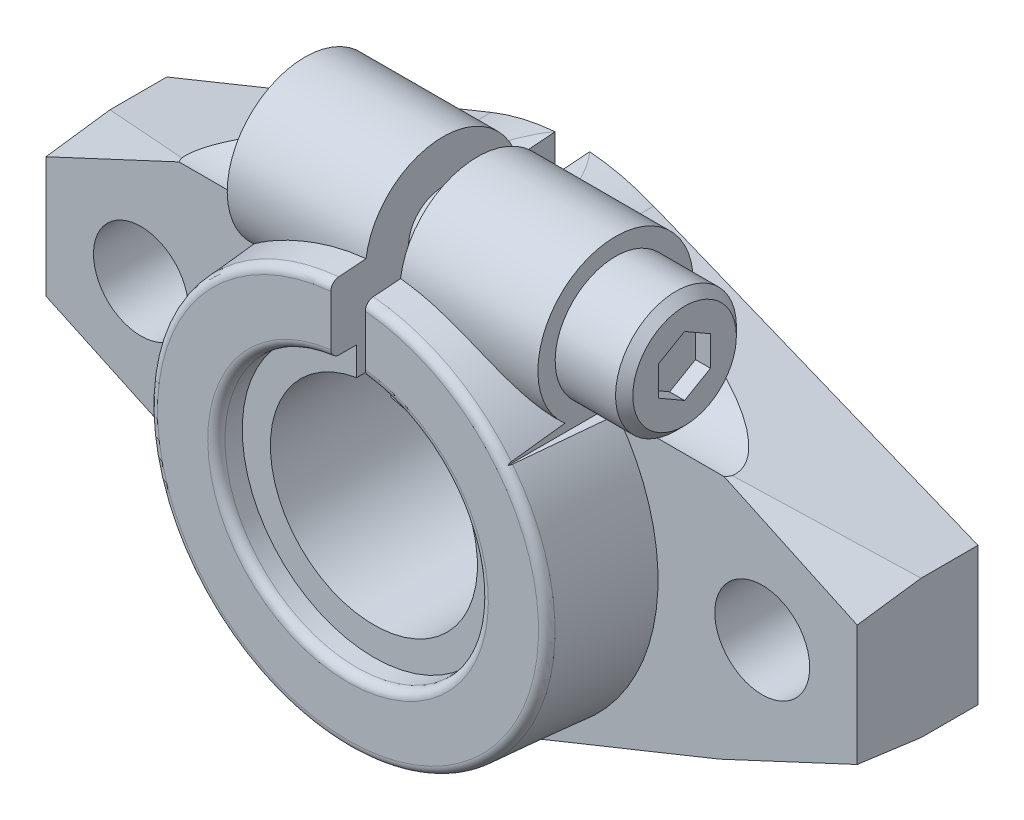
ISO-10303-21;
HEADER;
FILE_DESCRIPTION(('STEP AP214'),'2;1');
FILE_NAME('part.step','',(''),(''),'','','');
FILE_SCHEMA(('AUTOMOTIVE_DESIGN { 1 0 10303 214 1 1 1 1 }'));
ENDSEC;
DATA;
#1=APPLICATION_CONTEXT('core data for automotive mechanical design processes');
#2=APPLICATION_PROTOCOL_DEFINITION('international standard','automotive_design',2000,#1);
#3=PRODUCT_CONTEXT('',#1,'mechanical');
#4=PRODUCT('Part','Part','',(#3));
#5=PRODUCT_RELATED_PRODUCT_CATEGORY('part','',(#4));
#6=PRODUCT_DEFINITION_FORMATION('','',#4);
#7=PRODUCT_DEFINITION_CONTEXT('part definition',#1,'design');
#8=PRODUCT_DEFINITION('design','',#6,#7);
#9=PRODUCT_DEFINITION_SHAPE('','',#8);
#10=(LENGTH_UNIT() NAMED_UNIT(*) SI_UNIT(.MILLI.,.METRE.));
#11=(NAMED_UNIT(*) PLANE_ANGLE_UNIT() SI_UNIT($,.RADIAN.));
#12=(NAMED_UNIT(*) SI_UNIT($,.STERADIAN.) SOLID_ANGLE_UNIT());
#13=UNCERTAINTY_MEASURE_WITH_UNIT(LENGTH_MEASURE(1.E-05),#10,'distance_accuracy_value','');
#14=(GEOMETRIC_REPRESENTATION_CONTEXT(3) GLOBAL_UNCERTAINTY_ASSIGNED_CONTEXT((#13)) GLOBAL_UNIT_ASSIGNED_CONTEXT((#10,
#11,#12)) REPRESENTATION_CONTEXT('',''));
#15=CARTESIAN_POINT('',(0.,0.,0.));
#16=DIRECTION('',(0.,0.,1.));
#17=DIRECTION('',(1.,0.,0.));
#18=AXIS2_PLACEMENT_3D('',#15,#16,#17);
#19=CARTESIAN_POINT('',(-4.68404602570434,-11.5907757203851,0.));
#20=DIRECTION('',(-0.374125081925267,-0.927378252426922,0.));
#21=DIRECTION('',(-0.927378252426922,0.374125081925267,0.));
#22=AXIS2_PLACEMENT_3D('',#19,#20,#21);
#23=PLANE('',#22);
#24=DIRECTION('',(-0.851809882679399,0.343639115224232,-0.395388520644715));
#25=VECTOR('',#24,1.);
#26=CARTESIAN_POINT('',(-17.2586035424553,-6.51791861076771,6.19399561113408));
#27=LINE('',#26,#25);
#28=CARTESIAN_POINT('',(-15.5221785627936,-7.21843119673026,7.));
#29=VERTEX_POINT('',#28);
#30=CARTESIAN_POINT('',(-23.5,-4.,3.29689784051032));
#31=VERTEX_POINT('',#30);
#32=EDGE_CURVE('E817',#29,#31,#27,.T.);
#33=ORIENTED_EDGE('',*,*,#32,.T.);
#34=DIRECTION('',(0.,0.,1.));
#35=VECTOR('',#34,1.);
#36=CARTESIAN_POINT('',(-23.5,-4.,0.));
#37=LINE('',#36,#35);
#38=CARTESIAN_POINT('',(-23.5,-4.,0.));
#39=VERTEX_POINT('',#38);
#40=EDGE_CURVE('E824',#39,#31,#37,.T.);
#41=ORIENTED_EDGE('',*,*,#40,.F.);
#42=DIRECTION('',(0.927378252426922,-0.374125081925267,0.));
#43=VECTOR('',#42,1.);
#44=CARTESIAN_POINT('',(-23.5,-4.,0.));
#45=LINE('',#44,#43);
#46=CARTESIAN_POINT('',(-4.68404602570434,-11.5907757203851,0.));
#47=VERTEX_POINT('',#46);
#48=EDGE_CURVE('E763',#39,#47,#45,.T.);
#49=ORIENTED_EDGE('',*,*,#48,.T.);
#50=DIRECTION('',(0.,0.,1.));
#51=VECTOR('',#50,1.);
#52=CARTESIAN_POINT('',(-4.68404602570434,-11.5907757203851,0.));
#53=LINE('',#52,#51);
#54=CARTESIAN_POINT('',(-4.68404602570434,-11.5907757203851,7.));
#55=VERTEX_POINT('',#54);
#56=EDGE_CURVE('E811',#47,#55,#53,.T.);
#57=ORIENTED_EDGE('',*,*,#56,.T.);
#58=DIRECTION('',(-0.927378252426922,0.374125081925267,0.));
#59=VECTOR('',#58,1.);
#60=CARTESIAN_POINT('',(-23.5,-4.,7.));
#61=LINE('',#60,#59);
#62=EDGE_CURVE('E792',#55,#29,#61,.T.);
#63=ORIENTED_EDGE('',*,*,#62,.T.);
#64=EDGE_LOOP('',(#33,#41,#49,#57,#63));
#65=FACE_BOUND('',#64,.T.);
#66=ADVANCED_FACE('F55',(#65),#23,.T.);
#67=CARTESIAN_POINT('',(0.,0.0200000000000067,0.));
#68=DIRECTION('',(0.,0.,-1.));
#69=DIRECTION('',(-0.374125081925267,-0.927378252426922,0.));
#70=AXIS2_PLACEMENT_3D('',#67,#68,#69);
#71=CYLINDRICAL_SURFACE('',#70,12.52);
#72=CARTESIAN_POINT('',(0.,0.0200000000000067,162.76));
#73=DIRECTION('',(0.,0.997054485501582,-0.076696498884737));
#74=DIRECTION('',(0.,-0.076696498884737,-0.997054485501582));
#75=AXIS2_PLACEMENT_3D('',#72,#73,#74);
#76=ELLIPSE('',#75,163.240828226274,12.52);
#77=CARTESIAN_POINT('',(3.63223568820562,-11.9615384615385,7.));
#78=VERTEX_POINT('',#77);
#79=CARTESIAN_POINT('',(0.,-12.5,0.));
#80=VERTEX_POINT('',#79);
#81=EDGE_CURVE('E779',#78,#80,#76,.T.);
#82=ORIENTED_EDGE('',*,*,#81,.T.);
#83=CARTESIAN_POINT('',(0.,0.0200000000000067,0.));
#84=DIRECTION('',(0.,0.,1.));
#85=DIRECTION('',(-0.374125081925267,-0.927378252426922,0.));
#86=AXIS2_PLACEMENT_3D('',#83,#84,#85);
#87=CIRCLE('',#86,12.52);
#88=CARTESIAN_POINT('',(4.68404602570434,-11.5907757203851,0.));
#89=VERTEX_POINT('',#88);
#90=EDGE_CURVE('E764',#80,#89,#87,.T.);
#91=ORIENTED_EDGE('',*,*,#90,.T.);
#92=DIRECTION('',(0.,0.,1.));
#93=VECTOR('',#92,1.);
#94=CARTESIAN_POINT('',(4.68404602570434,-11.5907757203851,0.));
#95=LINE('',#94,#93);
#96=CARTESIAN_POINT('',(4.68404602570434,-11.5907757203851,7.));
#97=VERTEX_POINT('',#96);
#98=EDGE_CURVE('E834',#89,#97,#95,.T.);
#99=ORIENTED_EDGE('',*,*,#98,.T.);
#100=CARTESIAN_POINT('',(0.,0.0200000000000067,7.));
#101=DIRECTION('',(0.,0.,-1.));
#102=DIRECTION('',(-0.374125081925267,-0.927378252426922,0.));
#103=AXIS2_PLACEMENT_3D('',#100,#101,#102);
#104=CIRCLE('',#103,12.52);
#105=EDGE_CURVE('E635',#97,#78,#104,.T.);
#106=ORIENTED_EDGE('',*,*,#105,.T.);
#107=EDGE_LOOP('',(#82,#91,#99,#106));
#108=FACE_BOUND('',#107,.T.);
#109=ADVANCED_FACE('F898',(#108),#71,.T.);
#110=CARTESIAN_POINT('',(23.5,4.,0.));
#111=DIRECTION('',(1.,0.,0.));
#112=DIRECTION('',(0.,1.,0.));
#113=AXIS2_PLACEMENT_3D('',#110,#111,#112);
#114=PLANE('',#113);
#115=DIRECTION('',(0.,-0.134251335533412,-0.990947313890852));
#116=VECTOR('',#115,1.);
#117=CARTESIAN_POINT('',(23.5,-4.33046557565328,0.857637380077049));
#118=LINE('',#117,#116);
#119=CARTESIAN_POINT('',(23.5,-3.4983119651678,7.));
#120=VERTEX_POINT('',#119);
#121=CARTESIAN_POINT('',(23.5,-4.,3.29689784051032));
#122=VERTEX_POINT('',#121);
#123=EDGE_CURVE('E830',#120,#122,#118,.T.);
#124=ORIENTED_EDGE('',*,*,#123,.T.);
#125=DIRECTION('',(0.,0.,1.));
#126=VECTOR('',#125,1.);
#127=CARTESIAN_POINT('',(23.5,-4.,0.));
#128=LINE('',#127,#126);
#129=CARTESIAN_POINT('',(23.5,-4.,0.));
#130=VERTEX_POINT('',#129);
#131=EDGE_CURVE('E837',#130,#122,#128,.T.);
#132=ORIENTED_EDGE('',*,*,#131,.F.);
#133=DIRECTION('',(0.,1.,0.));
#134=VECTOR('',#133,1.);
#135=CARTESIAN_POINT('',(23.5,-4.,0.));
#136=LINE('',#135,#134);
#137=CARTESIAN_POINT('',(23.5,4.,0.));
#138=VERTEX_POINT('',#137);
#139=EDGE_CURVE('E674',#130,#138,#136,.T.);
#140=ORIENTED_EDGE('',*,*,#139,.T.);
#141=DIRECTION('',(0.,0.,1.));
#142=VECTOR('',#141,1.);
#143=CARTESIAN_POINT('',(23.5,4.,0.));
#144=LINE('',#143,#142);
#145=CARTESIAN_POINT('',(23.5,4.,3.29689784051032));
#146=VERTEX_POINT('',#145);
#147=EDGE_CURVE('E455',#138,#146,#144,.T.);
#148=ORIENTED_EDGE('',*,*,#147,.T.);
#149=DIRECTION('',(0.,-0.134251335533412,0.990947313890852));
#150=VECTOR('',#149,1.);
#151=CARTESIAN_POINT('',(23.5,4.4025592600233,0.325493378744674));
#152=LINE('',#151,#150);
#153=CARTESIAN_POINT('',(23.5,3.4983119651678,7.));
#154=VERTEX_POINT('',#153);
#155=EDGE_CURVE('E449',#146,#154,#152,.T.);
#156=ORIENTED_EDGE('',*,*,#155,.T.);
#157=DIRECTION('',(0.,-1.,0.));
#158=VECTOR('',#157,1.);
#159=CARTESIAN_POINT('',(23.5,-4.,7.));
#160=LINE('',#159,#158);
#161=EDGE_CURVE('E570',#154,#120,#160,.T.);
#162=ORIENTED_EDGE('',*,*,#161,.T.);
#163=EDGE_LOOP('',(#124,#132,#140,#148,#156,#162));
#164=FACE_BOUND('',#163,.T.);
#165=ADVANCED_FACE('F1419',(#164),#114,.T.);
#166=CARTESIAN_POINT('',(-25.1778725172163,3.59820922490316,0.48747737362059));
#167=DIRECTION('',(-0.419468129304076,0.89955230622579,0.121869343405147));
#168=DIRECTION('',(0.278996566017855,0.,0.960292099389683));
#169=AXIS2_PLACEMENT_3D('',#166,#167,#168);
#170=PLANE('',#169);
#171=CARTESIAN_POINT('',(-7.55784460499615,11.,6.5));
#172=DIRECTION('',(0.419468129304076,-0.89955230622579,-0.121869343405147));
#173=DIRECTION('',(0.907770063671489,0.415670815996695,0.056314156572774));
#174=AXIS2_PLACEMENT_3D('',#171,#172,#173);
#175=ELLIPSE('',#174,9.39284709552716,3.94);
#176=CARTESIAN_POINT('',(-15.7936228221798,7.09185465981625,7.));
#177=VERTEX_POINT('',#176);
#178=CARTESIAN_POINT('',(-15.9438922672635,7.06437473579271,6.68561729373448));
#179=VERTEX_POINT('',#178);
#180=EDGE_CURVE('E658',#177,#179,#175,.T.);
#181=ORIENTED_EDGE('',*,*,#180,.T.);
#182=DIRECTION('',(0.855733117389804,0.347042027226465,0.38377423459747));
#183=VECTOR('',#182,1.);
#184=CARTESIAN_POINT('',(-25.1766793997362,3.32002372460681,2.54495036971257));
#185=LINE('',#184,#183);
#186=CARTESIAN_POINT('',(-23.5,4.,3.29689784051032));
#187=VERTEX_POINT('',#186);
#188=EDGE_CURVE('E703',#187,#179,#185,.T.);
#189=ORIENTED_EDGE('',*,*,#188,.F.);
#190=DIRECTION('',(0.,0.134251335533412,-0.990947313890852));
#191=VECTOR('',#190,1.);
#192=CARTESIAN_POINT('',(-23.5,4.33046557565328,0.857637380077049));
#193=LINE('',#192,#191);
#194=CARTESIAN_POINT('',(-23.5,3.4983119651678,7.));
#195=VERTEX_POINT('',#194);
#196=EDGE_CURVE('E821',#195,#187,#193,.T.);
#197=ORIENTED_EDGE('',*,*,#196,.F.);
#198=DIRECTION('',(-0.90630778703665,-0.422618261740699,0.));
#199=VECTOR('',#198,1.);
#200=CARTESIAN_POINT('',(-15.1885540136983,7.37400287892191,7.));
#201=LINE('',#200,#199);
#202=EDGE_CURVE('E565',#177,#195,#201,.T.);
#203=ORIENTED_EDGE('',*,*,#202,.F.);
#204=EDGE_LOOP('',(#181,#189,#197,#203));
#205=FACE_BOUND('',#204,.T.);
#206=ADVANCED_FACE('F1429',(#205),#170,.T.);
#207=CARTESIAN_POINT('',(23.5,-4.,0.));
#208=DIRECTION('',(0.374125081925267,-0.927378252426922,0.));
#209=DIRECTION('',(0.,0.,-1.));
#210=AXIS2_PLACEMENT_3D('',#207,#208,#209);
#211=PLANE('',#210);
#212=DIRECTION('',(-0.851809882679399,-0.343639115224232,0.395388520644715));
#213=VECTOR('',#212,1.);
#214=CARTESIAN_POINT('',(25.1958118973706,-3.31587163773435,2.50974501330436));
#215=LINE('',#214,#213);
#216=CARTESIAN_POINT('',(15.5221785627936,-7.21843119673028,7.));
#217=VERTEX_POINT('',#216);
#218=EDGE_CURVE('E827',#122,#217,#215,.T.);
#219=ORIENTED_EDGE('',*,*,#218,.T.);
#220=DIRECTION('',(-0.927378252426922,-0.374125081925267,0.));
#221=VECTOR('',#220,1.);
#222=CARTESIAN_POINT('',(4.68404602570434,-11.5907757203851,7.));
#223=LINE('',#222,#221);
#224=EDGE_CURVE('E639',#217,#97,#223,.T.);
#225=ORIENTED_EDGE('',*,*,#224,.T.);
#226=ORIENTED_EDGE('',*,*,#98,.F.);
#227=DIRECTION('',(0.927378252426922,0.374125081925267,0.));
#228=VECTOR('',#227,1.);
#229=CARTESIAN_POINT('',(4.68404602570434,-11.5907757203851,0.));
#230=LINE('',#229,#228);
#231=EDGE_CURVE('E799',#89,#130,#230,.T.);
#232=ORIENTED_EDGE('',*,*,#231,.T.);
#233=ORIENTED_EDGE('',*,*,#131,.T.);
#234=EDGE_LOOP('',(#219,#225,#226,#232,#233));
#235=FACE_BOUND('',#234,.T.);
#236=ADVANCED_FACE('F994',(#235),#211,.T.);
#237=CARTESIAN_POINT('',(25.1778725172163,-3.59820922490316,0.48747737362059));
#238=DIRECTION('',(-0.419468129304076,0.89955230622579,-0.121869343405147));
#239=DIRECTION('',(-0.278996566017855,0.,0.960292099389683));
#240=AXIS2_PLACEMENT_3D('',#237,#238,#239);
#241=PLANE('',#240);
#242=DIRECTION('',(0.90630778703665,0.422618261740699,0.));
#243=VECTOR('',#242,1.);
#244=CARTESIAN_POINT('',(15.1885540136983,-7.37400287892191,7.));
#245=LINE('',#244,#243);
#246=EDGE_CURVE('E647',#217,#120,#245,.T.);
#247=ORIENTED_EDGE('',*,*,#246,.F.);
#248=ORIENTED_EDGE('',*,*,#218,.F.);
#249=ORIENTED_EDGE('',*,*,#123,.F.);
#250=EDGE_LOOP('',(#247,#248,#249));
#251=FACE_BOUND('',#250,.T.);
#252=ADVANCED_FACE('F990',(#251),#241,.F.);
#253=CARTESIAN_POINT('',(-23.5,-4.,0.));
#254=DIRECTION('',(-1.,0.,0.));
#255=DIRECTION('',(0.,0.,1.));
#256=AXIS2_PLACEMENT_3D('',#253,#254,#255);
#257=PLANE('',#256);
#258=DIRECTION('',(0.,0.134251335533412,0.990947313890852));
#259=VECTOR('',#258,1.);
#260=CARTESIAN_POINT('',(-23.5,-4.4025592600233,0.325493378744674));
#261=LINE('',#260,#259);
#262=CARTESIAN_POINT('',(-23.5,-3.4983119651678,7.));
#263=VERTEX_POINT('',#262);
#264=EDGE_CURVE('E814',#31,#263,#261,.T.);
#265=ORIENTED_EDGE('',*,*,#264,.T.);
#266=DIRECTION('',(0.,1.,0.));
#267=VECTOR('',#266,1.);
#268=CARTESIAN_POINT('',(-23.5,4.,7.));
#269=LINE('',#268,#267);
#270=EDGE_CURVE('E569',#263,#195,#269,.T.);
#271=ORIENTED_EDGE('',*,*,#270,.T.);
#272=ORIENTED_EDGE('',*,*,#196,.T.);
#273=DIRECTION('',(0.,0.,1.));
#274=VECTOR('',#273,1.);
#275=CARTESIAN_POINT('',(-23.5,4.,0.));
#276=LINE('',#275,#274);
#277=CARTESIAN_POINT('',(-23.5,4.,0.));
#278=VERTEX_POINT('',#277);
#279=EDGE_CURVE('E718',#278,#187,#276,.T.);
#280=ORIENTED_EDGE('',*,*,#279,.F.);
#281=DIRECTION('',(0.,-1.,0.));
#282=VECTOR('',#281,1.);
#283=CARTESIAN_POINT('',(-23.5,4.,0.));
#284=LINE('',#283,#282);
#285=EDGE_CURVE('E780',#278,#39,#284,.T.);
#286=ORIENTED_EDGE('',*,*,#285,.T.);
#287=ORIENTED_EDGE('',*,*,#40,.T.);
#288=EDGE_LOOP('',(#265,#271,#272,#280,#286,#287));
#289=FACE_BOUND('',#288,.T.);
#290=ADVANCED_FACE('F993',(#289),#257,.T.);
#291=CARTESIAN_POINT('',(-25.1778725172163,-3.59820922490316,0.48747737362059));
#292=DIRECTION('',(-0.419468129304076,-0.89955230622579,0.121869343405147));
#293=DIRECTION('',(-0.90630778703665,0.422618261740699,0.));
#294=AXIS2_PLACEMENT_3D('',#291,#292,#293);
#295=PLANE('',#294);
#296=DIRECTION('',(0.90630778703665,-0.422618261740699,0.));
#297=VECTOR('',#296,1.);
#298=CARTESIAN_POINT('',(-15.1885540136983,-7.37400287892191,7.));
#299=LINE('',#298,#297);
#300=EDGE_CURVE('E755',#263,#29,#299,.T.);
#301=ORIENTED_EDGE('',*,*,#300,.F.);
#302=ORIENTED_EDGE('',*,*,#264,.F.);
#303=ORIENTED_EDGE('',*,*,#32,.F.);
#304=EDGE_LOOP('',(#301,#302,#303));
#305=FACE_BOUND('',#304,.T.);
#306=ADVANCED_FACE('F1451',(#305),#295,.T.);
#307=CARTESIAN_POINT('',(0.,0.0200000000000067,0.));
#308=DIRECTION('',(0.,0.,-1.));
#309=DIRECTION('',(-0.374125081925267,-0.927378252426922,0.));
#310=AXIS2_PLACEMENT_3D('',#307,#308,#309);
#311=CYLINDRICAL_SURFACE('',#310,12.52);
#312=CARTESIAN_POINT('',(0.,0.0200000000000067,162.76));
#313=DIRECTION('',(0.,0.997054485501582,-0.076696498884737));
#314=DIRECTION('',(0.,-0.076696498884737,-0.997054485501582));
#315=AXIS2_PLACEMENT_3D('',#312,#313,#314);
#316=ELLIPSE('',#315,163.240828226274,12.52);
#317=CARTESIAN_POINT('',(-3.63223568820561,-11.9615384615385,7.));
#318=VERTEX_POINT('',#317);
#319=EDGE_CURVE('E776',#80,#318,#316,.T.);
#320=ORIENTED_EDGE('',*,*,#319,.T.);
#321=CARTESIAN_POINT('',(0.,0.0200000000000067,7.));
#322=DIRECTION('',(0.,0.,-1.));
#323=DIRECTION('',(-0.374125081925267,-0.927378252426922,0.));
#324=AXIS2_PLACEMENT_3D('',#321,#322,#323);
#325=CIRCLE('',#324,12.52);
#326=EDGE_CURVE('E675',#318,#55,#325,.T.);
#327=ORIENTED_EDGE('',*,*,#326,.T.);
#328=ORIENTED_EDGE('',*,*,#56,.F.);
#329=CARTESIAN_POINT('',(0.,0.0200000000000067,0.));
#330=DIRECTION('',(0.,0.,1.));
#331=DIRECTION('',(-0.374125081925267,-0.927378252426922,0.));
#332=AXIS2_PLACEMENT_3D('',#329,#330,#331);
#333=CIRCLE('',#332,12.52);
#334=EDGE_CURVE('E759',#47,#80,#333,.T.);
#335=ORIENTED_EDGE('',*,*,#334,.T.);
#336=EDGE_LOOP('',(#320,#327,#328,#335));
#337=FACE_BOUND('',#336,.T.);
#338=ADVANCED_FACE('F1003',(#337),#311,.T.);
#339=CARTESIAN_POINT('',(5.,-12.5,0.));
#340=DIRECTION('',(0.,0.997054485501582,-0.076696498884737));
#341=DIRECTION('',(-1.,0.,0.));
#342=AXIS2_PLACEMENT_3D('',#339,#340,#341);
#343=PLANE('',#342);
#344=DIRECTION('',(1.,0.,0.));
#345=VECTOR('',#344,1.);
#346=CARTESIAN_POINT('',(2.5,-11.9615384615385,7.));
#347=LINE('',#346,#345);
#348=CARTESIAN_POINT('',(0.,-11.9615384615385,7.));
#349=VERTEX_POINT('',#348);
#350=EDGE_CURVE('E671',#318,#349,#347,.T.);
#351=ORIENTED_EDGE('',*,*,#350,.F.);
#352=ORIENTED_EDGE('',*,*,#319,.F.);
#353=ORIENTED_EDGE('',*,*,#81,.F.);
#354=DIRECTION('',(1.,0.,0.));
#355=VECTOR('',#354,1.);
#356=CARTESIAN_POINT('',(2.5,-11.9615384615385,7.));
#357=LINE('',#356,#355);
#358=EDGE_CURVE('E640',#349,#78,#357,.T.);
#359=ORIENTED_EDGE('',*,*,#358,.F.);
#360=EDGE_LOOP('',(#351,#352,#353,#359));
#361=FACE_BOUND('',#360,.T.);
#362=ADVANCED_FACE('F1000',(#361),#343,.F.);
#363=CARTESIAN_POINT('',(0.,0.,0.));
#364=DIRECTION('',(0.,0.,1.));
#365=DIRECTION('',(1.,0.,0.));
#366=AXIS2_PLACEMENT_3D('',#363,#364,#365);
#367=PLANE('',#366);
#368=CARTESIAN_POINT('',(-18.,0.,0.));
#369=DIRECTION('',(0.,0.,1.));
#370=DIRECTION('',(0.,1.,0.));
#371=AXIS2_PLACEMENT_3D('',#368,#369,#370);
#372=CIRCLE('',#371,2.75);
#373=CARTESIAN_POINT('',(-18.,-2.75,0.));
#374=VERTEX_POINT('',#373);
#375=EDGE_CURVE('E584',#374,#374,#372,.T.);
#376=ORIENTED_EDGE('',*,*,#375,.T.);
#377=EDGE_LOOP('',(#376));
#378=FACE_BOUND('',#377,.T.);
#379=CARTESIAN_POINT('',(18.,0.,0.));
#380=DIRECTION('',(0.,0.,1.));
#381=DIRECTION('',(0.,1.,0.));
#382=AXIS2_PLACEMENT_3D('',#379,#380,#381);
#383=CIRCLE('',#382,2.75);
#384=CARTESIAN_POINT('',(18.,-2.75,0.));
#385=VERTEX_POINT('',#384);
#386=EDGE_CURVE('E575',#385,#385,#383,.T.);
#387=ORIENTED_EDGE('',*,*,#386,.T.);
#388=EDGE_LOOP('',(#387));
#389=FACE_BOUND('',#388,.T.);
#390=DIRECTION('',(0.,-1.,0.));
#391=VECTOR('',#390,1.);
#392=CARTESIAN_POINT('',(-1.,0.,0.));
#393=LINE('',#392,#391);
#394=CARTESIAN_POINT('',(-1.00000000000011,12.5,0.));
#395=VERTEX_POINT('',#394);
#396=CARTESIAN_POINT('',(-1.,6.42261628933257,0.));
#397=VERTEX_POINT('',#396);
#398=EDGE_CURVE('E519',#395,#397,#393,.T.);
#399=ORIENTED_EDGE('',*,*,#398,.T.);
#400=CARTESIAN_POINT('',(0.,0.,0.));
#401=DIRECTION('',(0.,0.,1.));
#402=DIRECTION('',(1.,0.,0.));
#403=AXIS2_PLACEMENT_3D('',#400,#401,#402);
#404=CIRCLE('',#403,6.5);
#405=CARTESIAN_POINT('',(1.,6.42261628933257,0.));
#406=VERTEX_POINT('',#405);
#407=EDGE_CURVE('E840',#397,#406,#404,.T.);
#408=ORIENTED_EDGE('',*,*,#407,.T.);
#409=DIRECTION('',(0.,1.,0.));
#410=VECTOR('',#409,1.);
#411=CARTESIAN_POINT('',(1.,6.25,0.));
#412=LINE('',#411,#410);
#413=CARTESIAN_POINT('',(1.00000000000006,12.5,0.));
#414=VERTEX_POINT('',#413);
#415=EDGE_CURVE('E682',#406,#414,#412,.T.);
#416=ORIENTED_EDGE('',*,*,#415,.T.);
#417=CARTESIAN_POINT('',(0.,0.0200000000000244,0.));
#418=DIRECTION('',(0.,0.,1.));
#419=DIRECTION('',(0.375819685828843,0.926692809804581,0.));
#420=AXIS2_PLACEMENT_3D('',#417,#418,#419);
#421=CIRCLE('',#420,12.52);
#422=CARTESIAN_POINT('',(4.70526246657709,11.6221939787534,0.));
#423=VERTEX_POINT('',#422);
#424=EDGE_CURVE('E767',#423,#414,#421,.T.);
#425=ORIENTED_EDGE('',*,*,#424,.F.);
#426=DIRECTION('',(-0.926692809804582,0.375819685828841,0.));
#427=VECTOR('',#426,1.);
#428=CARTESIAN_POINT('',(23.5,4.,0.));
#429=LINE('',#428,#427);
#430=EDGE_CURVE('E541',#138,#423,#429,.T.);
#431=ORIENTED_EDGE('',*,*,#430,.F.);
#432=ORIENTED_EDGE('',*,*,#139,.F.);
#433=ORIENTED_EDGE('',*,*,#231,.F.);
#434=ORIENTED_EDGE('',*,*,#90,.F.);
#435=ORIENTED_EDGE('',*,*,#334,.F.);
#436=ORIENTED_EDGE('',*,*,#48,.F.);
#437=ORIENTED_EDGE('',*,*,#285,.F.);
#438=DIRECTION('',(-0.926692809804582,-0.375819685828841,0.));
#439=VECTOR('',#438,1.);
#440=CARTESIAN_POINT('',(-4.70526246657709,11.6221939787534,0.));
#441=LINE('',#440,#439);
#442=CARTESIAN_POINT('',(-4.70526246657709,11.6221939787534,0.));
#443=VERTEX_POINT('',#442);
#444=EDGE_CURVE('E714',#443,#278,#441,.T.);
#445=ORIENTED_EDGE('',*,*,#444,.F.);
#446=CARTESIAN_POINT('',(0.,0.0200000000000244,0.));
#447=DIRECTION('',(0.,0.,1.));
#448=DIRECTION('',(0.375819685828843,0.926692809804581,0.));
#449=AXIS2_PLACEMENT_3D('',#446,#447,#448);
#450=CIRCLE('',#449,12.52);
#451=EDGE_CURVE('E699',#395,#443,#450,.T.);
#452=ORIENTED_EDGE('',*,*,#451,.F.);
#453=EDGE_LOOP('',(#399,#408,#416,#425,#431,#432,#433,#434,#435,#436,#437,#445,#452));
#454=FACE_BOUND('',#453,.T.);
#455=ADVANCED_FACE('F869',(#378,#389,#454),#367,.F.);
#456=CARTESIAN_POINT('',(0.,0.,7.));
#457=DIRECTION('',(0.,0.,1.));
#458=DIRECTION('',(1.,0.,0.));
#459=AXIS2_PLACEMENT_3D('',#456,#457,#458);
#460=PLANE('',#459);
#461=CARTESIAN_POINT('',(-18.,0.,7.));
#462=DIRECTION('',(0.,0.,-1.));
#463=DIRECTION('',(0.,1.,0.));
#464=AXIS2_PLACEMENT_3D('',#461,#462,#463);
#465=CIRCLE('',#464,2.75);
#466=CARTESIAN_POINT('',(-18.,-2.75,7.));
#467=VERTEX_POINT('',#466);
#468=EDGE_CURVE('E587',#467,#467,#465,.T.);
#469=ORIENTED_EDGE('',*,*,#468,.T.);
#470=EDGE_LOOP('',(#469));
#471=FACE_BOUND('',#470,.T.);
#472=DIRECTION('',(-1.,0.,0.));
#473=VECTOR('',#472,1.);
#474=CARTESIAN_POINT('',(-8.0475,7.09185465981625,7.));
#475=LINE('',#474,#473);
#476=CARTESIAN_POINT('',(-9.63244516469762,7.09185465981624,7.));
#477=VERTEX_POINT('',#476);
#478=EDGE_CURVE('E662',#477,#177,#475,.T.);
#479=ORIENTED_EDGE('',*,*,#478,.T.);
#480=ORIENTED_EDGE('',*,*,#202,.T.);
#481=ORIENTED_EDGE('',*,*,#270,.F.);
#482=ORIENTED_EDGE('',*,*,#300,.T.);
#483=ORIENTED_EDGE('',*,*,#62,.F.);
#484=ORIENTED_EDGE('',*,*,#326,.F.);
#485=ORIENTED_EDGE('',*,*,#350,.T.);
#486=CARTESIAN_POINT('',(0.,0.,7.));
#487=DIRECTION('',(0.,0.,-1.));
#488=DIRECTION('',(0.,1.,0.));
#489=AXIS2_PLACEMENT_3D('',#486,#487,#488);
#490=CIRCLE('',#489,11.9615384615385);
#491=EDGE_CURVE('E628',#349,#477,#490,.T.);
#492=ORIENTED_EDGE('',*,*,#491,.T.);
#493=EDGE_LOOP('',(#479,#480,#481,#482,#483,#484,#485,#492));
#494=FACE_BOUND('',#493,.T.);
#495=ADVANCED_FACE('F865',(#471,#494),#460,.T.);
#496=CARTESIAN_POINT('',(0.,0.,7.));
#497=DIRECTION('',(0.,0.,1.));
#498=DIRECTION('',(1.,0.,0.));
#499=AXIS2_PLACEMENT_3D('',#496,#497,#498);
#500=PLANE('',#499);
#501=CARTESIAN_POINT('',(18.,0.,7.));
#502=DIRECTION('',(0.,0.,-1.));
#503=DIRECTION('',(0.,1.,0.));
#504=AXIS2_PLACEMENT_3D('',#501,#502,#503);
#505=CIRCLE('',#504,2.75);
#506=CARTESIAN_POINT('',(18.,-2.75,7.));
#507=VERTEX_POINT('',#506);
#508=EDGE_CURVE('E576',#507,#507,#505,.T.);
#509=ORIENTED_EDGE('',*,*,#508,.T.);
#510=EDGE_LOOP('',(#509));
#511=FACE_BOUND('',#510,.T.);
#512=DIRECTION('',(-1.,0.,0.));
#513=VECTOR('',#512,1.);
#514=CARTESIAN_POINT('',(8.0475,7.09185465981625,7.));
#515=LINE('',#514,#513);
#516=CARTESIAN_POINT('',(15.7936228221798,7.09185465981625,7.));
#517=VERTEX_POINT('',#516);
#518=CARTESIAN_POINT('',(9.63244516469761,7.09185465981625,7.));
#519=VERTEX_POINT('',#518);
#520=EDGE_CURVE('E465',#517,#519,#515,.T.);
#521=ORIENTED_EDGE('',*,*,#520,.T.);
#522=CARTESIAN_POINT('',(0.,0.,7.));
#523=DIRECTION('',(0.,0.,-1.));
#524=DIRECTION('',(0.,1.,0.));
#525=AXIS2_PLACEMENT_3D('',#522,#523,#524);
#526=CIRCLE('',#525,11.9615384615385);
#527=EDGE_CURVE('E608',#519,#349,#526,.T.);
#528=ORIENTED_EDGE('',*,*,#527,.T.);
#529=ORIENTED_EDGE('',*,*,#358,.T.);
#530=ORIENTED_EDGE('',*,*,#105,.F.);
#531=ORIENTED_EDGE('',*,*,#224,.F.);
#532=ORIENTED_EDGE('',*,*,#246,.T.);
#533=ORIENTED_EDGE('',*,*,#161,.F.);
#534=DIRECTION('',(-0.90630778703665,0.422618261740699,0.));
#535=VECTOR('',#534,1.);
#536=CARTESIAN_POINT('',(15.1885540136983,7.37400287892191,7.));
#537=LINE('',#536,#535);
#538=EDGE_CURVE('E773',#154,#517,#537,.T.);
#539=ORIENTED_EDGE('',*,*,#538,.T.);
#540=EDGE_LOOP('',(#521,#528,#529,#530,#531,#532,#533,#539));
#541=FACE_BOUND('',#540,.T.);
#542=ADVANCED_FACE('F868',(#511,#541),#500,.T.);
#543=CARTESIAN_POINT('',(5.,11.5,13.));
#544=DIRECTION('',(0.,-0.997054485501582,-0.076696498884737));
#545=DIRECTION('',(0.,0.076696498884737,-0.997054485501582));
#546=AXIS2_PLACEMENT_3D('',#543,#544,#545);
#547=PLANE('',#546);
#548=DIRECTION('',(1.,0.,0.));
#549=VECTOR('',#548,1.);
#550=CARTESIAN_POINT('',(1.75341658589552,12.330673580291,2.20124345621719));
#551=LINE('',#550,#549);
#552=CARTESIAN_POINT('',(1.,12.330673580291,2.20124345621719));
#553=VERTEX_POINT('',#552);
#554=CARTESIAN_POINT('',(2.27984999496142,12.330673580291,2.20124345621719));
#555=VERTEX_POINT('',#554);
#556=EDGE_CURVE('E2332',#553,#555,#551,.T.);
#557=ORIENTED_EDGE('',*,*,#556,.T.);
#558=CARTESIAN_POINT('',(0.,0.0200000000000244,162.24));
#559=DIRECTION('',(0.,-0.997054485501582,-0.076696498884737));
#560=DIRECTION('',(0.,0.076696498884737,-0.997054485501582));
#561=AXIS2_PLACEMENT_3D('',#558,#559,#560);
#562=ELLIPSE('',#561,163.240828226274,12.52);
#563=EDGE_CURVE('E456',#414,#555,#562,.T.);
#564=ORIENTED_EDGE('',*,*,#563,.F.);
#565=DIRECTION('',(0.,-0.076696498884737,0.997054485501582));
#566=VECTOR('',#565,1.);
#567=CARTESIAN_POINT('',(1.,12.,6.5));
#568=LINE('',#567,#566);
#569=EDGE_CURVE('E740',#414,#553,#568,.T.);
#570=ORIENTED_EDGE('',*,*,#569,.T.);
#571=EDGE_LOOP('',(#557,#564,#570));
#572=FACE_BOUND('',#571,.T.);
#573=ADVANCED_FACE('F1494',(#572),#547,.F.);
#574=CARTESIAN_POINT('',(0.,6.815,11.5));
#575=DIRECTION('',(0.,0.,-1.));
#576=DIRECTION('',(0.,-1.,0.));
#577=AXIS2_PLACEMENT_3D('',#574,#575,#576);
#578=PLANE('',#577);
#579=DIRECTION('',(0.,1.,0.));
#580=VECTOR('',#579,1.);
#581=CARTESIAN_POINT('',(-1.,3.4075,11.5));
#582=LINE('',#581,#580);
#583=CARTESIAN_POINT('',(-1.,5.91607978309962,11.5));
#584=VERTEX_POINT('',#583);
#585=CARTESIAN_POINT('',(-1.,7.56418534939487,11.5));
#586=VERTEX_POINT('',#585);
#587=EDGE_CURVE('E524',#584,#586,#582,.T.);
#588=ORIENTED_EDGE('',*,*,#587,.T.);
#589=CARTESIAN_POINT('',(0.,0.,11.5));
#590=DIRECTION('',(0.,0.,1.));
#591=DIRECTION('',(0.,1.,0.));
#592=AXIS2_PLACEMENT_3D('',#589,#590,#591);
#593=CIRCLE('',#592,7.63);
#594=CARTESIAN_POINT('',(1.,7.56418534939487,11.5));
#595=VERTEX_POINT('',#594);
#596=EDGE_CURVE('E1303',#586,#595,#593,.T.);
#597=ORIENTED_EDGE('',*,*,#596,.T.);
#598=DIRECTION('',(0.,-1.,0.));
#599=VECTOR('',#598,1.);
#600=CARTESIAN_POINT('',(1.,9.6575,11.5));
#601=LINE('',#600,#599);
#602=CARTESIAN_POINT('',(1.,5.91607978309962,11.5));
#603=VERTEX_POINT('',#602);
#604=EDGE_CURVE('E679',#595,#603,#601,.T.);
#605=ORIENTED_EDGE('',*,*,#604,.T.);
#606=CARTESIAN_POINT('',(0.,0.,11.5));
#607=DIRECTION('',(0.,0.,1.));
#608=DIRECTION('',(0.,1.,0.));
#609=AXIS2_PLACEMENT_3D('',#606,#607,#608);
#610=CIRCLE('',#609,6.);
#611=EDGE_CURVE('E1320',#584,#603,#610,.T.);
#612=ORIENTED_EDGE('',*,*,#611,.F.);
#613=EDGE_LOOP('',(#588,#597,#605,#612));
#614=FACE_BOUND('',#613,.T.);
#615=ADVANCED_FACE('F1171',(#614),#578,.F.);
#616=CARTESIAN_POINT('',(1.,12.5,0.));
#617=DIRECTION('',(1.,0.,0.));
#618=DIRECTION('',(0.,1.,0.));
#619=AXIS2_PLACEMENT_3D('',#616,#617,#618);
#620=PLANE('',#619);
#621=CARTESIAN_POINT('',(1.,11.,6.5));
#622=DIRECTION('',(-1.,0.,0.));
#623=DIRECTION('',(0.,1.,0.));
#624=AXIS2_PLACEMENT_3D('',#621,#622,#623);
#625=CIRCLE('',#624,2.);
#626=CARTESIAN_POINT('',(1.,9.,6.5));
#627=VERTEX_POINT('',#626);
#628=EDGE_CURVE('E467',#627,#627,#625,.T.);
#629=ORIENTED_EDGE('',*,*,#628,.F.);
#630=EDGE_LOOP('',(#629));
#631=FACE_BOUND('',#630,.T.);
#632=ORIENTED_EDGE('',*,*,#415,.F.);
#633=CARTESIAN_POINT('',(1.,6.42261628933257,0.));
#634=CARTESIAN_POINT('',(1.,6.39386055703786,-2.25555972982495E-05));
#635=CARTESIAN_POINT('',(1.,6.36511076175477,0.00242066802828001));
#636=CARTESIAN_POINT('',(1.,6.30843461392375,0.0120691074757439));
#637=CARTESIAN_POINT('',(1.,6.28050788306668,0.0192720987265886));
#638=CARTESIAN_POINT('',(1.,6.22624592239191,0.0382761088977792));
#639=CARTESIAN_POINT('',(1.,6.19991159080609,0.0500796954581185));
#640=CARTESIAN_POINT('',(1.,6.14961656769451,0.0779565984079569));
#641=CARTESIAN_POINT('',(1.,6.12565527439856,0.0940288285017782));
#642=CARTESIAN_POINT('',(1.,6.08091226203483,0.12992113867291));
#643=CARTESIAN_POINT('',(1.,6.06011601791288,0.149723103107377));
#644=CARTESIAN_POINT('',(1.,6.02218809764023,0.192580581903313));
#645=CARTESIAN_POINT('',(1.,6.00505702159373,0.215636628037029));
#646=CARTESIAN_POINT('',(1.,5.97517377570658,0.264048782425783));
#647=CARTESIAN_POINT('',(1.,5.96237195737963,0.289374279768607));
#648=CARTESIAN_POINT('',(1.,5.94127216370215,0.341827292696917));
#649=CARTESIAN_POINT('',(1.,5.93297065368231,0.368953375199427));
#650=CARTESIAN_POINT('',(1.,5.92340234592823,0.413566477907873));
#651=CARTESIAN_POINT('',(1.,5.920658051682,0.430750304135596));
#652=CARTESIAN_POINT('',(1.,5.91699717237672,0.465286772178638));
#653=CARTESIAN_POINT('',(1.,5.91607799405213,0.482639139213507));
#654=CARTESIAN_POINT('',(1.,5.91607978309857,0.499999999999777));
#655=B_SPLINE_CURVE_WITH_KNOTS('',3,(#633,#634,#635,#636,#637,#638,#639,#640,#641,#642,#643,
#644,#645,#646,#647,#648,#649,#650,#651,#652,#653,#654),.UNSPECIFIED.,.F.,.F.,(4,2,2,2,2,2,2,2,
2,2,4),(0.,0.0861554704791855,0.172270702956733,0.258434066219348,0.344575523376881,
0.430308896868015,0.516056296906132,0.600784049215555,0.685445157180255,0.737560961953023,
0.78960266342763),.UNSPECIFIED.);
#656=CARTESIAN_POINT('',(1.,5.91607978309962,0.5));
#657=VERTEX_POINT('',#656);
#658=EDGE_CURVE('E1182',#406,#657,#655,.T.);
#659=ORIENTED_EDGE('',*,*,#658,.T.);
#660=DIRECTION('',(0.,0.,-1.));
#661=VECTOR('',#660,1.);
#662=CARTESIAN_POINT('',(1.,5.91607978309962,5.75));
#663=LINE('',#662,#661);
#664=EDGE_CURVE('E1312',#603,#657,#663,.T.);
#665=ORIENTED_EDGE('',*,*,#664,.F.);
#666=ORIENTED_EDGE('',*,*,#604,.F.);
#667=DIRECTION('',(0.,0.,-1.));
#668=VECTOR('',#667,1.);
#669=CARTESIAN_POINT('',(1.,7.56418534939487,12.25));
#670=LINE('',#669,#668);
#671=CARTESIAN_POINT('',(1.,7.56418534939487,12.5));
#672=VERTEX_POINT('',#671);
#673=EDGE_CURVE('E475',#672,#595,#670,.T.);
#674=ORIENTED_EDGE('',*,*,#673,.F.);
#675=CARTESIAN_POINT('',(1.,7.56418534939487,12.5));
#676=CARTESIAN_POINT('',(1.,7.56416038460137,12.5279569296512));
#677=CARTESIAN_POINT('',(1.,7.56654898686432,12.5559051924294));
#678=CARTESIAN_POINT('',(1.,7.57596725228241,12.610979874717));
#679=CARTESIAN_POINT('',(1.,7.58299208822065,12.6381071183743));
#680=CARTESIAN_POINT('',(1.,7.60150107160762,12.6908069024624));
#681=CARTESIAN_POINT('',(1.,7.61298696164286,12.7163788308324));
#682=CARTESIAN_POINT('',(1.,7.6400693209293,12.7652391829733));
#683=CARTESIAN_POINT('',(1.,7.65566536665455,12.788527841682));
#684=CARTESIAN_POINT('',(1.,7.69058612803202,12.8322680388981));
#685=CARTESIAN_POINT('',(1.,7.7099252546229,12.8527080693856));
#686=CARTESIAN_POINT('',(1.,7.75174013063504,12.890086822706));
#687=CARTESIAN_POINT('',(1.,7.77421654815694,12.9070247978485));
#688=CARTESIAN_POINT('',(1.,7.82186053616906,12.9370608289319));
#689=CARTESIAN_POINT('',(1.,7.84704874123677,12.9501261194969));
#690=CARTESIAN_POINT('',(1.,7.89924641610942,12.9718700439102));
#691=CARTESIAN_POINT('',(1.,7.9262550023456,12.9805507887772));
#692=CARTESIAN_POINT('',(1.,7.97254884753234,12.9912686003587));
#693=CARTESIAN_POINT('',(1.,7.99155767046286,12.9945406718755));
#694=CARTESIAN_POINT('',(1.,8.02979681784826,12.9989062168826));
#695=CARTESIAN_POINT('',(1.,8.04902679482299,13.0000027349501));
#696=CARTESIAN_POINT('',(1.,8.06826499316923,13.));
#697=B_SPLINE_CURVE_WITH_KNOTS('',3,(#675,#676,#677,#678,#679,#680,#681,#682,#683,#684,#685,
#686,#687,#688,#689,#690,#691,#692,#693,#694,#695,#696),.UNSPECIFIED.,.F.,.F.,(4,2,2,2,2,2,2,2,
2,2,4),(0.,0.0837562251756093,0.167425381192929,0.25112725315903,0.334820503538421,
0.418842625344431,0.502882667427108,0.587614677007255,0.672305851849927,0.730054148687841,
0.787721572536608),.UNSPECIFIED.);
#698=CARTESIAN_POINT('',(1.,8.06826499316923,13.));
#699=VERTEX_POINT('',#698);
#700=EDGE_CURVE('E1176',#672,#699,#697,.T.);
#701=ORIENTED_EDGE('',*,*,#700,.T.);
#702=DIRECTION('',(0.,-1.,0.));
#703=VECTOR('',#702,1.);
#704=CARTESIAN_POINT('',(1.,9.125,13.));
#705=LINE('',#704,#703);
#706=CARTESIAN_POINT('',(1.,10.9915888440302,13.));
#707=VERTEX_POINT('',#706);
#708=EDGE_CURVE('E513',#707,#699,#705,.T.);
#709=ORIENTED_EDGE('',*,*,#708,.F.);
#710=CARTESIAN_POINT('',(1.,10.9915888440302,13.));
#711=CARTESIAN_POINT('',(1.,11.0199116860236,13.0000235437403));
#712=CARTESIAN_POINT('',(1.,11.048228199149,12.9976145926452));
#713=CARTESIAN_POINT('',(1.,11.1040446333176,12.9881033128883));
#714=CARTESIAN_POINT('',(1.,11.1315450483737,12.9810038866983));
#715=CARTESIAN_POINT('',(1.,11.1849765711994,12.9622778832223));
#716=CARTESIAN_POINT('',(1.,11.2109068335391,12.9506488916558));
#717=CARTESIAN_POINT('',(1.,11.2604353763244,12.9231986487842));
#718=CARTESIAN_POINT('',(1.,11.2840342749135,12.9073785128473));
#719=CARTESIAN_POINT('',(1.,11.3281834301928,12.8720233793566));
#720=CARTESIAN_POINT('',(1.,11.3487398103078,12.8524960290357));
#721=CARTESIAN_POINT('',(1.,11.3862753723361,12.8102470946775));
#722=CARTESIAN_POINT('',(1.,11.4032532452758,12.7875243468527));
#723=CARTESIAN_POINT('',(1.,11.43307745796,12.739622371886));
#724=CARTESIAN_POINT('',(1.,11.4459373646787,12.714451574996));
#725=CARTESIAN_POINT('',(1.,11.4672180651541,12.6623179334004));
#726=CARTESIAN_POINT('',(1.,11.4756444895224,12.6353574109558));
#727=CARTESIAN_POINT('',(1.,11.4842802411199,12.5964451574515));
#728=CARTESIAN_POINT('',(1.,11.4864173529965,12.5848939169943));
#729=CARTESIAN_POINT('',(1.,11.4898677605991,12.5616898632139));
#730=CARTESIAN_POINT('',(1.,11.4911825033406,12.5500372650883));
#731=CARTESIAN_POINT('',(1.,11.4920855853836,12.5383473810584));
#732=B_SPLINE_CURVE_WITH_KNOTS('',3,(#710,#711,#712,#713,#714,#715,#716,#717,#718,#719,#720,
#721,#722,#723,#724,#725,#726,#727,#728,#729,#730,#731),.UNSPECIFIED.,.F.,.F.,(4,2,2,2,2,2,2,2,
2,2,4),(0.,0.0848573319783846,0.169662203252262,0.254512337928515,0.339339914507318,
0.423994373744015,0.508679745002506,0.593083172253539,0.677379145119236,0.7125972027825,
0.747753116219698),.UNSPECIFIED.);
#733=CARTESIAN_POINT('',(1.,11.4920841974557,12.5383470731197));
#734=VERTEX_POINT('',#733);
#735=EDGE_CURVE('E934',#707,#734,#732,.T.);
#736=ORIENTED_EDGE('',*,*,#735,.T.);
#737=DIRECTION('',(0.,-0.0769824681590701,0.997032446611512));
#738=VECTOR('',#737,1.);
#739=CARTESIAN_POINT('',(1.,11.614113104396,10.9578991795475));
#740=LINE('',#739,#738);
#741=CARTESIAN_POINT('',(1.,11.614113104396,10.9578991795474));
#742=VERTEX_POINT('',#741);
#743=EDGE_CURVE('E693',#742,#734,#740,.T.);
#744=ORIENTED_EDGE('',*,*,#743,.F.);
#745=CARTESIAN_POINT('',(1.,11.,6.5));
#746=DIRECTION('',(-1.,0.,0.));
#747=DIRECTION('',(0.,1.,0.));
#748=AXIS2_PLACEMENT_3D('',#745,#746,#747);
#749=CIRCLE('',#748,4.5);
#750=EDGE_CURVE('E2326',#742,#553,#749,.T.);
#751=ORIENTED_EDGE('',*,*,#750,.T.);
#752=ORIENTED_EDGE('',*,*,#569,.F.);
#753=EDGE_LOOP('',(#632,#659,#665,#666,#674,#701,#709,#736,#744,#751,#752));
#754=FACE_BOUND('',#753,.T.);
#755=ADVANCED_FACE('F1167',(#631,#754),#620,.F.);
#756=CARTESIAN_POINT('',(25.1778725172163,3.59820922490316,0.48747737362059));
#757=DIRECTION('',(-0.419468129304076,-0.89955230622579,-0.121869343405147));
#758=DIRECTION('',(-0.90630778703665,0.422618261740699,0.));
#759=AXIS2_PLACEMENT_3D('',#756,#757,#758);
#760=PLANE('',#759);
#761=CARTESIAN_POINT('',(7.55784460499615,11.,6.5));
#762=DIRECTION('',(-0.419468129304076,-0.89955230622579,-0.121869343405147));
#763=DIRECTION('',(-0.907770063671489,0.415670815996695,0.056314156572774));
#764=AXIS2_PLACEMENT_3D('',#761,#762,#763);
#765=ELLIPSE('',#764,9.39284709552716,3.94);
#766=CARTESIAN_POINT('',(15.9438922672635,7.06437473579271,6.6856172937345));
#767=VERTEX_POINT('',#766);
#768=EDGE_CURVE('E446',#767,#517,#765,.T.);
#769=ORIENTED_EDGE('',*,*,#768,.T.);
#770=ORIENTED_EDGE('',*,*,#538,.F.);
#771=ORIENTED_EDGE('',*,*,#155,.F.);
#772=DIRECTION('',(0.855733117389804,-0.347042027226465,-0.38377423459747));
#773=VECTOR('',#772,1.);
#774=CARTESIAN_POINT('',(17.1633801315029,6.56981219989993,6.13870843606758));
#775=LINE('',#774,#773);
#776=EDGE_CURVE('E442',#767,#146,#775,.T.);
#777=ORIENTED_EDGE('',*,*,#776,.F.);
#778=EDGE_LOOP('',(#769,#770,#771,#777));
#779=FACE_BOUND('',#778,.T.);
#780=ADVANCED_FACE('F444',(#779),#760,.F.);
#781=CARTESIAN_POINT('',(4.70526246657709,11.6221939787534,0.));
#782=DIRECTION('',(0.375819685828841,0.926692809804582,0.));
#783=DIRECTION('',(0.,0.,-1.));
#784=AXIS2_PLACEMENT_3D('',#781,#782,#783);
#785=PLANE('',#784);
#786=DIRECTION('',(0.,0.,1.));
#787=VECTOR('',#786,1.);
#788=CARTESIAN_POINT('',(9.,9.88046587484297,3.25));
#789=LINE('',#788,#787);
#790=CARTESIAN_POINT('',(9.,9.88046587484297,2.14148610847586));
#791=VERTEX_POINT('',#790);
#792=CARTESIAN_POINT('',(9.,9.88046587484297,2.72240243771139));
#793=VERTEX_POINT('',#792);
#794=EDGE_CURVE('E471',#791,#793,#789,.T.);
#795=ORIENTED_EDGE('',*,*,#794,.T.);
#796=CARTESIAN_POINT('',(6.23946279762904,11.,6.5));
#797=DIRECTION('',(-0.375819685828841,-0.926692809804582,0.));
#798=DIRECTION('',(-0.926692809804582,0.375819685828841,0.));
#799=AXIS2_PLACEMENT_3D('',#796,#797,#798);
#800=ELLIPSE('',#799,10.483750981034,3.94);
#801=EDGE_CURVE('E462',#793,#767,#800,.T.);
#802=ORIENTED_EDGE('',*,*,#801,.T.);
#803=ORIENTED_EDGE('',*,*,#776,.T.);
#804=ORIENTED_EDGE('',*,*,#147,.F.);
#805=ORIENTED_EDGE('',*,*,#430,.T.);
#806=DIRECTION('',(0.,0.,1.));
#807=VECTOR('',#806,1.);
#808=CARTESIAN_POINT('',(4.70526246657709,11.6221939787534,0.));
#809=LINE('',#808,#807);
#810=CARTESIAN_POINT('',(4.70526246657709,11.6221939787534,2.0432214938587));
#811=VERTEX_POINT('',#810);
#812=EDGE_CURVE('E702',#423,#811,#809,.T.);
#813=ORIENTED_EDGE('',*,*,#812,.T.);
#814=CARTESIAN_POINT('',(6.23946279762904,11.,6.5));
#815=DIRECTION('',(-0.375819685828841,-0.926692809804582,0.));
#816=DIRECTION('',(-0.926692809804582,0.375819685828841,0.));
#817=AXIS2_PLACEMENT_3D('',#814,#815,#816);
#818=ELLIPSE('',#817,11.9738272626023,4.5);
#819=EDGE_CURVE('E2346',#811,#791,#818,.T.);
#820=ORIENTED_EDGE('',*,*,#819,.T.);
#821=EDGE_LOOP('',(#795,#802,#803,#804,#805,#813,#820));
#822=FACE_BOUND('',#821,.T.);
#823=ADVANCED_FACE('F469',(#822),#785,.T.);
#824=CARTESIAN_POINT('',(0.,0.0200000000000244,0.));
#825=DIRECTION('',(0.,0.,-1.));
#826=DIRECTION('',(0.375819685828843,0.926692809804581,0.));
#827=AXIS2_PLACEMENT_3D('',#824,#825,#826);
#828=CYLINDRICAL_SURFACE('',#827,12.52);
#829=CARTESIAN_POINT('',(2.27984999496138,12.330673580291,2.20124345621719));
#830=CARTESIAN_POINT('',(2.3529271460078,12.3171401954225,2.19701839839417));
#831=CARTESIAN_POINT('',(2.42587453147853,12.3029578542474,2.19262995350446));
#832=CARTESIAN_POINT('',(2.59176685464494,12.269170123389,2.18237508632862));
#833=CARTESIAN_POINT('',(2.68462399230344,12.249154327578,2.17643738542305));
#834=CARTESIAN_POINT('',(2.89002182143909,12.202428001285,2.16309799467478));
#835=CARTESIAN_POINT('',(3.00244455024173,12.1752088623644,2.15565912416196));
#836=CARTESIAN_POINT('',(3.24651698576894,12.1125231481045,2.13924146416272));
#837=CARTESIAN_POINT('',(3.37800932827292,12.0764521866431,2.13022521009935));
#838=CARTESIAN_POINT('',(3.63396673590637,12.001722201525,2.11263871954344));
#839=CARTESIAN_POINT('',(3.7584856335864,11.9632478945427,2.10406637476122));
#840=CARTESIAN_POINT('',(3.99060232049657,11.8875376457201,2.08835347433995));
#841=CARTESIAN_POINT('',(4.09834718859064,11.850761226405,2.08116901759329));
#842=CARTESIAN_POINT('',(4.29727589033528,11.779817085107,2.06816497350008));
#843=CARTESIAN_POINT('',(4.3885973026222,11.7460434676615,2.06229845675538));
#844=CARTESIAN_POINT('',(4.55504616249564,11.6822680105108,2.05200116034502));
#845=CARTESIAN_POINT('',(4.63029576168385,11.6525966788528,2.04749553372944));
#846=CARTESIAN_POINT('',(4.70526246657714,11.6221939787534,2.0432214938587));
#847=B_SPLINE_CURVE_WITH_KNOTS('',3,(#829,#830,#831,#832,#833,#834,#835,#836,#837,#838,#839,
#840,#841,#842,#843,#844,#845,#846),.UNSPECIFIED.,.F.,.F.,(4,2,2,2,2,2,2,2,4),(0.,
0.223316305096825,0.508817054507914,0.856502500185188,1.26637160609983,1.65813481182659,
2.0003169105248,2.29291908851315,2.53594426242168),.UNSPECIFIED.);
#848=EDGE_CURVE('E1034',#555,#811,#847,.T.);
#849=ORIENTED_EDGE('',*,*,#848,.T.);
#850=ORIENTED_EDGE('',*,*,#812,.F.);
#851=ORIENTED_EDGE('',*,*,#424,.T.);
#852=ORIENTED_EDGE('',*,*,#563,.T.);
#853=EDGE_LOOP('',(#849,#850,#851,#852));
#854=FACE_BOUND('',#853,.T.);
#855=ADVANCED_FACE('F1009',(#854),#828,.T.);
#856=CARTESIAN_POINT('',(0.,0.0200000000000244,0.));
#857=DIRECTION('',(0.,0.,-1.));
#858=DIRECTION('',(0.375819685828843,0.926692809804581,0.));
#859=AXIS2_PLACEMENT_3D('',#856,#857,#858);
#860=CYLINDRICAL_SURFACE('',#859,12.52);
#861=CARTESIAN_POINT('',(-4.70526246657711,11.6221939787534,2.04322149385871));
#862=CARTESIAN_POINT('',(-4.62945308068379,11.6529384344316,2.04754037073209));
#863=CARTESIAN_POINT('',(-4.55335426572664,11.6829350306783,2.05209364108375));
#864=CARTESIAN_POINT('',(-4.38592631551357,11.7470437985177,2.06244738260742));
#865=CARTESIAN_POINT('',(-4.29448022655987,11.7808393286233,2.06831939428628));
#866=CARTESIAN_POINT('',(-4.09603869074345,11.8515543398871,2.08129524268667));
#867=CARTESIAN_POINT('',(-3.9889127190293,11.8880993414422,2.08844507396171));
#868=CARTESIAN_POINT('',(-3.75879103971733,11.9631361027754,2.10405085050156));
#869=CARTESIAN_POINT('',(-3.63565663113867,12.0011939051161,2.11255033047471));
#870=CARTESIAN_POINT('',(-3.38328323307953,12.0749478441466,2.12993552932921));
#871=CARTESIAN_POINT('',(-3.25399838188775,12.1104867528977,2.13882299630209));
#872=CARTESIAN_POINT('',(-3.01273228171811,12.1726575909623,2.15507758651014));
#873=CARTESIAN_POINT('',(-2.90089457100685,12.1998380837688,2.16248171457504));
#874=CARTESIAN_POINT('',(-2.69501806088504,12.2468766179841,2.17584595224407));
#875=CARTESIAN_POINT('',(-2.60108845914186,12.2672027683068,2.18184268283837));
#876=CARTESIAN_POINT('',(-2.43138057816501,12.3018864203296,2.19232026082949));
#877=CARTESIAN_POINT('',(-2.35568496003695,12.3166294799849,2.19686641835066));
#878=CARTESIAN_POINT('',(-2.27984999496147,12.330673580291,2.20124345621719));
#879=B_SPLINE_CURVE_WITH_KNOTS('',3,(#861,#862,#863,#864,#865,#866,#867,#868,#869,#870,#871,
#872,#873,#874,#875,#876,#877,#878),.UNSPECIFIED.,.F.,.F.,(4,2,2,2,2,2,2,2,4),(0.,
0.245756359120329,0.53873235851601,0.87893114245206,1.26635416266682,1.66940770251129,
2.01535767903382,2.30420353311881,2.535945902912),.UNSPECIFIED.);
#880=CARTESIAN_POINT('',(-4.70526246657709,11.6221939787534,2.0432214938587));
#881=VERTEX_POINT('',#880);
#882=CARTESIAN_POINT('',(-2.27984999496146,12.330673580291,2.20124345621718));
#883=VERTEX_POINT('',#882);
#884=EDGE_CURVE('E1152',#881,#883,#879,.T.);
#885=ORIENTED_EDGE('',*,*,#884,.T.);
#886=CARTESIAN_POINT('',(0.,0.0200000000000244,162.24));
#887=DIRECTION('',(0.,-0.997054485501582,-0.076696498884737));
#888=DIRECTION('',(0.,0.076696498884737,-0.997054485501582));
#889=AXIS2_PLACEMENT_3D('',#886,#887,#888);
#890=ELLIPSE('',#889,163.240828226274,12.52);
#891=EDGE_CURVE('E650',#883,#395,#890,.T.);
#892=ORIENTED_EDGE('',*,*,#891,.T.);
#893=ORIENTED_EDGE('',*,*,#451,.T.);
#894=DIRECTION('',(0.,0.,1.));
#895=VECTOR('',#894,1.);
#896=CARTESIAN_POINT('',(-4.70526246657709,11.6221939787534,0.));
#897=LINE('',#896,#895);
#898=EDGE_CURVE('E523',#443,#881,#897,.T.);
#899=ORIENTED_EDGE('',*,*,#898,.T.);
#900=EDGE_LOOP('',(#885,#892,#893,#899));
#901=FACE_BOUND('',#900,.T.);
#902=ADVANCED_FACE('F1013',(#901),#860,.T.);
#903=CARTESIAN_POINT('',(-23.5,4.,0.));
#904=DIRECTION('',(-0.375819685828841,0.926692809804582,0.));
#905=DIRECTION('',(0.,0.,1.));
#906=AXIS2_PLACEMENT_3D('',#903,#904,#905);
#907=PLANE('',#906);
#908=CARTESIAN_POINT('',(-6.23946279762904,11.,6.5));
#909=DIRECTION('',(0.375819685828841,-0.926692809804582,0.));
#910=DIRECTION('',(0.926692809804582,0.375819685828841,0.));
#911=AXIS2_PLACEMENT_3D('',#908,#909,#910);
#912=ELLIPSE('',#911,11.9738272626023,4.5);
#913=CARTESIAN_POINT('',(-9.,9.88046587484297,2.14148610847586));
#914=VERTEX_POINT('',#913);
#915=EDGE_CURVE('E1144',#914,#881,#912,.T.);
#916=ORIENTED_EDGE('',*,*,#915,.T.);
#917=ORIENTED_EDGE('',*,*,#898,.F.);
#918=ORIENTED_EDGE('',*,*,#444,.T.);
#919=ORIENTED_EDGE('',*,*,#279,.T.);
#920=ORIENTED_EDGE('',*,*,#188,.T.);
#921=CARTESIAN_POINT('',(-6.23946279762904,11.,6.5));
#922=DIRECTION('',(0.375819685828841,-0.926692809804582,0.));
#923=DIRECTION('',(0.926692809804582,0.375819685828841,0.));
#924=AXIS2_PLACEMENT_3D('',#921,#922,#923);
#925=ELLIPSE('',#924,10.483750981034,3.94);
#926=CARTESIAN_POINT('',(-9.,9.88046587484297,2.72240243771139));
#927=VERTEX_POINT('',#926);
#928=EDGE_CURVE('E654',#179,#927,#925,.T.);
#929=ORIENTED_EDGE('',*,*,#928,.T.);
#930=DIRECTION('',(0.,0.,-1.));
#931=VECTOR('',#930,1.);
#932=CARTESIAN_POINT('',(-9.,9.88046587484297,3.25));
#933=LINE('',#932,#931);
#934=EDGE_CURVE('E552',#927,#914,#933,.T.);
#935=ORIENTED_EDGE('',*,*,#934,.T.);
#936=EDGE_LOOP('',(#916,#917,#918,#919,#920,#929,#935));
#937=FACE_BOUND('',#936,.T.);
#938=ADVANCED_FACE('F1102',(#937),#907,.T.);
#939=CARTESIAN_POINT('',(-1.,0.,0.));
#940=DIRECTION('',(-1.,0.,0.));
#941=DIRECTION('',(0.,0.,1.));
#942=AXIS2_PLACEMENT_3D('',#939,#940,#941);
#943=PLANE('',#942);
#944=CARTESIAN_POINT('',(-1.,11.,6.5));
#945=DIRECTION('',(-1.,0.,0.));
#946=DIRECTION('',(0.,1.,0.));
#947=AXIS2_PLACEMENT_3D('',#944,#945,#946);
#948=CIRCLE('',#947,2.);
#949=CARTESIAN_POINT('',(-1.,9.,6.5));
#950=VERTEX_POINT('',#949);
#951=EDGE_CURVE('E500',#950,#950,#948,.T.);
#952=ORIENTED_EDGE('',*,*,#951,.T.);
#953=EDGE_LOOP('',(#952));
#954=FACE_BOUND('',#953,.T.);
#955=DIRECTION('',(0.,0.,1.));
#956=VECTOR('',#955,1.);
#957=CARTESIAN_POINT('',(-1.,5.91607978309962,5.75));
#958=LINE('',#957,#956);
#959=CARTESIAN_POINT('',(-1.,5.91607978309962,0.5));
#960=VERTEX_POINT('',#959);
#961=EDGE_CURVE('E1328',#960,#584,#958,.T.);
#962=ORIENTED_EDGE('',*,*,#961,.F.);
#963=CARTESIAN_POINT('',(-0.999999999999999,5.91607978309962,0.5));
#964=CARTESIAN_POINT('',(-1.,5.91605413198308,0.472148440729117));
#965=CARTESIAN_POINT('',(-1.,5.91843832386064,0.444306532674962));
#966=CARTESIAN_POINT('',(-1.,5.92783404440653,0.389447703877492));
#967=CARTESIAN_POINT('',(-1.,5.93484001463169,0.362429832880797));
#968=CARTESIAN_POINT('',(-1.,5.95329085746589,0.309945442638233));
#969=CARTESIAN_POINT('',(-1.,5.96473720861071,0.28447944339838));
#970=CARTESIAN_POINT('',(-1.,5.99171333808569,0.235815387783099));
#971=CARTESIAN_POINT('',(-1.,6.00724288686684,0.212617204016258));
#972=CARTESIAN_POINT('',(-1.,6.04204177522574,0.168975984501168));
#973=CARTESIAN_POINT('',(-1.,6.0613344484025,0.148551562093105));
#974=CARTESIAN_POINT('',(-1.,6.10303929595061,0.111176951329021));
#975=CARTESIAN_POINT('',(-1.,6.12545216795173,0.0942275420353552));
#976=CARTESIAN_POINT('',(-1.,6.17307263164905,0.0640529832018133));
#977=CARTESIAN_POINT('',(-1.,6.19831318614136,0.0508799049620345));
#978=CARTESIAN_POINT('',(-1.,6.25062705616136,0.028910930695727));
#979=CARTESIAN_POINT('',(-1.,6.27769959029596,0.020113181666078));
#980=CARTESIAN_POINT('',(-1.,6.32451902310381,0.0090932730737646));
#981=CARTESIAN_POINT('',(-1.,6.34399562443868,0.00568581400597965));
#982=CARTESIAN_POINT('',(-1.,6.38318442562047,0.00113925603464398));
#983=CARTESIAN_POINT('',(-1.,6.40289626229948,-2.97413734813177E-06));
#984=CARTESIAN_POINT('',(-1.,6.42261628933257,0.));
#985=B_SPLINE_CURVE_WITH_KNOTS('',3,(#963,#964,#965,#966,#967,#968,#969,#970,#971,#972,#973,
#974,#975,#976,#977,#978,#979,#980,#981,#982,#983,#984),.UNSPECIFIED.,.F.,.F.,(4,2,2,2,2,2,2,2,
2,2,4),(0.,0.0834385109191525,0.166776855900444,0.25014297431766,0.333504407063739,
0.417400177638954,0.501314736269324,0.586336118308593,0.671321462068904,0.73051454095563,
0.789625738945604),.UNSPECIFIED.);
#986=EDGE_CURVE('E1088',#960,#397,#985,.T.);
#987=ORIENTED_EDGE('',*,*,#986,.T.);
#988=ORIENTED_EDGE('',*,*,#398,.F.);
#989=DIRECTION('',(0.,0.076696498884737,-0.997054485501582));
#990=VECTOR('',#989,1.);
#991=CARTESIAN_POINT('',(-1.,11.9632352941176,6.97794117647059));
#992=LINE('',#991,#990);
#993=CARTESIAN_POINT('',(-1.,12.330673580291,2.20124345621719));
#994=VERTEX_POINT('',#993);
#995=EDGE_CURVE('E745',#994,#395,#992,.T.);
#996=ORIENTED_EDGE('',*,*,#995,.F.);
#997=CARTESIAN_POINT('',(-1.,11.,6.5));
#998=DIRECTION('',(-1.,0.,0.));
#999=DIRECTION('',(0.,1.,0.));
#1000=AXIS2_PLACEMENT_3D('',#997,#998,#999);
#1001=CIRCLE('',#1000,4.5);
#1002=CARTESIAN_POINT('',(-1.,11.614113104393,10.9578991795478));
#1003=VERTEX_POINT('',#1002);
#1004=EDGE_CURVE('E528',#1003,#994,#1001,.T.);
#1005=ORIENTED_EDGE('',*,*,#1004,.F.);
#1006=DIRECTION('',(0.,0.0769824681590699,-0.997032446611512));
#1007=VECTOR('',#1006,1.);
#1008=CARTESIAN_POINT('',(-1.,11.4564392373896,13.));
#1009=LINE('',#1008,#1007);
#1010=CARTESIAN_POINT('',(-1.,11.4920841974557,12.5383470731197));
#1011=VERTEX_POINT('',#1010);
#1012=EDGE_CURVE('E514',#1011,#1003,#1009,.T.);
#1013=ORIENTED_EDGE('',*,*,#1012,.F.);
#1014=CARTESIAN_POINT('',(-1.,11.4920841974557,12.5383470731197));
#1015=CARTESIAN_POINT('',(-1.,11.4899488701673,12.5663298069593));
#1016=CARTESIAN_POINT('',(-1.,11.4854021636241,12.5941183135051));
#1017=CARTESIAN_POINT('',(-1.,11.4717291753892,12.6485205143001));
#1018=CARTESIAN_POINT('',(-1.,11.4626068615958,12.6751352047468));
#1019=CARTESIAN_POINT('',(-1.,11.4400163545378,12.7264657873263));
#1020=CARTESIAN_POINT('',(-1.,11.4265462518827,12.7511808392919));
#1021=CARTESIAN_POINT('',(-1.,11.3956597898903,12.7980000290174));
#1022=CARTESIAN_POINT('',(-1.,11.3782441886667,12.8201046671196));
#1023=CARTESIAN_POINT('',(-1.,11.3399264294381,12.8611278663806));
#1024=CARTESIAN_POINT('',(-1.,11.3190178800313,12.8800404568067));
#1025=CARTESIAN_POINT('',(-1.,11.2743239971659,12.9141094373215));
#1026=CARTESIAN_POINT('',(-1.,11.2505375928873,12.9292644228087));
#1027=CARTESIAN_POINT('',(-1.,11.2006696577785,12.9554442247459));
#1028=CARTESIAN_POINT('',(-1.,11.1745790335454,12.9664516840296));
#1029=CARTESIAN_POINT('',(-1.,11.1209385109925,12.9839343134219));
#1030=CARTESIAN_POINT('',(-1.,11.0933903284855,12.9904146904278));
#1031=CARTESIAN_POINT('',(-1.,11.053276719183,12.9963652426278));
#1032=CARTESIAN_POINT('',(-1.,11.0409670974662,12.9977287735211));
#1033=CARTESIAN_POINT('',(-1.,11.0163030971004,12.9995451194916));
#1034=CARTESIAN_POINT('',(-1.,11.0039488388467,12.9999995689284));
#1035=CARTESIAN_POINT('',(-1.,10.9915888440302,13.));
#1036=B_SPLINE_CURVE_WITH_KNOTS('',3,(#1014,#1015,#1016,#1017,#1018,#1019,#1020,#1021,#1022,
#1023,#1024,#1025,#1026,#1027,#1028,#1029,#1030,#1031,#1032,#1033,#1034,#1035),.UNSPECIFIED.,
.F.,.F.,(4,2,2,2,2,2,2,2,2,2,4),(0.,0.0840785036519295,0.168084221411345,0.252126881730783,
0.336153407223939,0.420335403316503,0.50454881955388,0.589110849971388,0.673575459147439,
0.710702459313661,0.747762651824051),.UNSPECIFIED.);
#1037=CARTESIAN_POINT('',(-1.,10.9915888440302,13.));
#1038=VERTEX_POINT('',#1037);
#1039=EDGE_CURVE('E945',#1011,#1038,#1036,.T.);
#1040=ORIENTED_EDGE('',*,*,#1039,.T.);
#1041=DIRECTION('',(0.,1.,0.));
#1042=VECTOR('',#1041,1.);
#1043=CARTESIAN_POINT('',(-1.,2.875,13.));
#1044=LINE('',#1043,#1042);
#1045=CARTESIAN_POINT('',(-1.,8.06826499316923,13.));
#1046=VERTEX_POINT('',#1045);
#1047=EDGE_CURVE('E683',#1046,#1038,#1044,.T.);
#1048=ORIENTED_EDGE('',*,*,#1047,.F.);
#1049=CARTESIAN_POINT('',(-1.,8.06826499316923,13.));
#1050=CARTESIAN_POINT('',(-1.,8.03974422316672,13.0000230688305));
#1051=CARTESIAN_POINT('',(-1.,8.01122972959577,12.997597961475));
#1052=CARTESIAN_POINT('',(-1.,7.95502145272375,12.9880228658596));
#1053=CARTESIAN_POINT('',(-1.,7.92732720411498,12.9808756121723));
#1054=CARTESIAN_POINT('',(-1.,7.87351833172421,12.9620222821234));
#1055=CARTESIAN_POINT('',(-1.,7.84740456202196,12.9503137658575));
#1056=CARTESIAN_POINT('',(-1.,7.79752666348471,12.9226696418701));
#1057=CARTESIAN_POINT('',(-1.,7.77376199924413,12.9067350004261));
#1058=CARTESIAN_POINT('',(-1.,7.72933599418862,12.8711328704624));
#1059=CARTESIAN_POINT('',(-1.,7.70866529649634,12.8514770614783));
#1060=CARTESIAN_POINT('',(-1.,7.67094348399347,12.8089455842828));
#1061=CARTESIAN_POINT('',(-1.,7.65389301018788,12.7860693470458));
#1062=CARTESIAN_POINT('',(-1.,7.62403852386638,12.7379331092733));
#1063=CARTESIAN_POINT('',(-1.,7.6112040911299,12.7126919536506));
#1064=CARTESIAN_POINT('',(-1.,7.59000054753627,12.6604075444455));
#1065=CARTESIAN_POINT('',(-1.,7.58162827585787,12.6333655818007));
#1066=CARTESIAN_POINT('',(-1.,7.57181406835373,12.5884467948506));
#1067=CARTESIAN_POINT('',(-1.,7.56895503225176,12.5708669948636));
#1068=CARTESIAN_POINT('',(-1.,7.56514102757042,12.5355274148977));
#1069=CARTESIAN_POINT('',(-1.,7.56418335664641,12.517767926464));
#1070=CARTESIAN_POINT('',(-1.,7.56418534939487,12.5));
#1071=B_SPLINE_CURVE_WITH_KNOTS('',3,(#1049,#1050,#1051,#1052,#1053,#1054,#1055,#1056,#1057,
#1058,#1059,#1060,#1061,#1062,#1063,#1064,#1065,#1066,#1067,#1068,#1069,#1070),.UNSPECIFIED.,
.F.,.F.,(4,2,2,2,2,2,2,2,2,2,4),(0.,0.0854506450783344,0.170851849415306,0.256298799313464,
0.341726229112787,0.426889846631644,0.512068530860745,0.596618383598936,0.681108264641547,
0.734445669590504,0.78770721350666),.UNSPECIFIED.);
#1072=CARTESIAN_POINT('',(-1.,7.56418534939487,12.5));
#1073=VERTEX_POINT('',#1072);
#1074=EDGE_CURVE('E1107',#1046,#1073,#1071,.T.);
#1075=ORIENTED_EDGE('',*,*,#1074,.T.);
#1076=DIRECTION('',(0.,0.,1.));
#1077=VECTOR('',#1076,1.);
#1078=CARTESIAN_POINT('',(-1.,7.56418534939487,12.25));
#1079=LINE('',#1078,#1077);
#1080=EDGE_CURVE('E482',#586,#1073,#1079,.T.);
#1081=ORIENTED_EDGE('',*,*,#1080,.F.);
#1082=ORIENTED_EDGE('',*,*,#587,.F.);
#1083=EDGE_LOOP('',(#962,#987,#988,#996,#1005,#1013,#1040,#1048,#1075,#1081,#1082));
#1084=FACE_BOUND('',#1083,.T.);
#1085=ADVANCED_FACE('F1096',(#954,#1084),#943,.F.);
#1086=CARTESIAN_POINT('',(5.,11.5,13.));
#1087=DIRECTION('',(0.,-0.997054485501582,-0.076696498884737));
#1088=DIRECTION('',(0.,0.076696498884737,-0.997054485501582));
#1089=AXIS2_PLACEMENT_3D('',#1086,#1087,#1088);
#1090=PLANE('',#1089);
#1091=DIRECTION('',(1.,0.,0.));
#1092=VECTOR('',#1091,1.);
#1093=CARTESIAN_POINT('',(-1.75341658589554,12.330673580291,2.20124345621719));
#1094=LINE('',#1093,#1092);
#1095=EDGE_CURVE('E1127',#883,#994,#1094,.T.);
#1096=ORIENTED_EDGE('',*,*,#1095,.T.);
#1097=ORIENTED_EDGE('',*,*,#995,.T.);
#1098=ORIENTED_EDGE('',*,*,#891,.F.);
#1099=EDGE_LOOP('',(#1096,#1097,#1098));
#1100=FACE_BOUND('',#1099,.T.);
#1101=ADVANCED_FACE('F1101',(#1100),#1090,.F.);
#1102=CARTESIAN_POINT('',(9.,15.,6.5));
#1103=DIRECTION('',(1.,0.,0.));
#1104=DIRECTION('',(0.,1.,0.));
#1105=AXIS2_PLACEMENT_3D('',#1102,#1103,#1104);
#1106=PLANE('',#1105);
#1107=CARTESIAN_POINT('',(9.,11.,6.5));
#1108=DIRECTION('',(-1.,0.,0.));
#1109=DIRECTION('',(0.,1.,0.));
#1110=AXIS2_PLACEMENT_3D('',#1107,#1108,#1109);
#1111=CIRCLE('',#1110,3.5);
#1112=CARTESIAN_POINT('',(9.,7.5,6.5));
#1113=VERTEX_POINT('',#1112);
#1114=EDGE_CURVE('E518',#1113,#1113,#1111,.T.);
#1115=ORIENTED_EDGE('',*,*,#1114,.T.);
#1116=EDGE_LOOP('',(#1115));
#1117=FACE_BOUND('',#1116,.T.);
#1118=CARTESIAN_POINT('',(9.,7.15891053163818,13.));
#1119=CARTESIAN_POINT('',(9.,7.37254769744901,11.2711024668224));
#1120=CARTESIAN_POINT('',(9.,7.59127530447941,9.43778759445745));
#1121=(BOUNDED_CURVE() B_SPLINE_CURVE(2,(#1118,#1119,#1120),.UNSPECIFIED.,.F.,
.F.) B_SPLINE_CURVE_WITH_KNOTS((3,3),(0.,3.65707993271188),
.UNSPECIFIED.) CURVE() GEOMETRIC_REPRESENTATION_ITEM() RATIONAL_B_SPLINE_CURVE((1.,
1.00028523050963,1.00022523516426)) REPRESENTATION_ITEM(''));
#1122=CARTESIAN_POINT('',(9.,7.2158180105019,12.5383482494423));
#1123=VERTEX_POINT('',#1122);
#1124=CARTESIAN_POINT('',(9.,7.59127530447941,9.43778759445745));
#1125=VERTEX_POINT('',#1124);
#1126=EDGE_CURVE('E687',#1123,#1125,#1121,.T.);
#1127=ORIENTED_EDGE('',*,*,#1126,.F.);
#1128=CARTESIAN_POINT('',(9.,7.2158180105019,12.5383482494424));
#1129=CARTESIAN_POINT('',(9.,7.21326382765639,12.5594948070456));
#1130=CARTESIAN_POINT('',(9.,7.20850117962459,12.5802829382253));
#1131=CARTESIAN_POINT('',(9.,7.19538207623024,12.620166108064));
#1132=CARTESIAN_POINT('',(9.,7.18711263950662,12.6392894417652));
#1133=CARTESIAN_POINT('',(9.,7.1702858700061,12.6708970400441));
#1134=CARTESIAN_POINT('',(9.,7.16242619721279,12.6837663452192));
#1135=CARTESIAN_POINT('',(9.,7.14524368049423,12.7088244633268));
#1136=CARTESIAN_POINT('',(9.,7.13589770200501,12.7209974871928));
#1137=CARTESIAN_POINT('',(9.,7.126,12.7326867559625));
#1138=B_SPLINE_CURVE_WITH_KNOTS('',3,(#1128,#1129,#1130,#1131,#1132,#1133,#1134,#1135,#1136,
#1137),.UNSPECIFIED.,.F.,.F.,(4,2,2,2,4),(0.,0.0636613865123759,0.125827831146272,
0.17098725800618,0.216934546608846),.UNSPECIFIED.);
#1139=CARTESIAN_POINT('',(9.,7.126,12.7326867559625));
#1140=VERTEX_POINT('',#1139);
#1141=EDGE_CURVE('E955',#1123,#1140,#1138,.T.);
#1142=ORIENTED_EDGE('',*,*,#1141,.T.);
#1143=DIRECTION('',(0.,0.,-1.));
#1144=VECTOR('',#1143,1.);
#1145=CARTESIAN_POINT('',(9.,7.126,14.));
#1146=LINE('',#1145,#1144);
#1147=CARTESIAN_POINT('',(9.,7.126,7.21813926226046));
#1148=VERTEX_POINT('',#1147);
#1149=EDGE_CURVE('E510',#1140,#1148,#1146,.T.);
#1150=ORIENTED_EDGE('',*,*,#1149,.T.);
#1151=CARTESIAN_POINT('',(9.,11.,6.5));
#1152=DIRECTION('',(-1.,0.,0.));
#1153=DIRECTION('',(0.,1.,0.));
#1154=AXIS2_PLACEMENT_3D('',#1151,#1152,#1153);
#1155=CIRCLE('',#1154,3.94);
#1156=EDGE_CURVE('E474',#793,#1148,#1155,.T.);
#1157=ORIENTED_EDGE('',*,*,#1156,.F.);
#1158=ORIENTED_EDGE('',*,*,#794,.F.);
#1159=CARTESIAN_POINT('',(9.,11.,6.5));
#1160=DIRECTION('',(-1.,0.,0.));
#1161=DIRECTION('',(0.,1.,0.));
#1162=AXIS2_PLACEMENT_3D('',#1159,#1160,#1161);
#1163=CIRCLE('',#1162,4.5);
#1164=EDGE_CURVE('E1064',#1125,#791,#1163,.T.);
#1165=ORIENTED_EDGE('',*,*,#1164,.F.);
#1166=EDGE_LOOP('',(#1127,#1142,#1150,#1157,#1158,#1165));
#1167=FACE_BOUND('',#1166,.T.);
#1168=ADVANCED_FACE('F1764',(#1117,#1167),#1106,.T.);
#1169=CARTESIAN_POINT('',(13.,12.5,6.5));
#1170=DIRECTION('',(1.,0.,0.));
#1171=DIRECTION('',(0.,1.,0.));
#1172=AXIS2_PLACEMENT_3D('',#1169,#1170,#1171);
#1173=PLANE('',#1172);
#1174=DIRECTION('',(0.,0.5,0.866025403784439));
#1175=VECTOR('',#1174,1.);
#1176=CARTESIAN_POINT('',(13.,10.1049682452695,7.94975952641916));
#1177=LINE('',#1176,#1175);
#1178=CARTESIAN_POINT('',(13.,9.26794919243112,6.5));
#1179=VERTEX_POINT('',#1178);
#1180=CARTESIAN_POINT('',(13.,10.1339745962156,8.));
#1181=VERTEX_POINT('',#1180);
#1182=EDGE_CURVE('E727',#1179,#1181,#1177,.T.);
#1183=ORIENTED_EDGE('',*,*,#1182,.T.);
#1184=DIRECTION('',(0.,1.,0.));
#1185=VECTOR('',#1184,1.);
#1186=CARTESIAN_POINT('',(13.,12.1830127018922,8.));
#1187=LINE('',#1186,#1185);
#1188=CARTESIAN_POINT('',(13.,11.8660254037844,8.));
#1189=VERTEX_POINT('',#1188);
#1190=EDGE_CURVE('E553',#1181,#1189,#1187,.T.);
#1191=ORIENTED_EDGE('',*,*,#1190,.T.);
#1192=DIRECTION('',(0.,0.5,-0.866025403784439));
#1193=VECTOR('',#1192,1.);
#1194=CARTESIAN_POINT('',(13.,12.7030444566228,6.55024047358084));
#1195=LINE('',#1194,#1193);
#1196=CARTESIAN_POINT('',(13.,12.7320508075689,6.5));
#1197=VERTEX_POINT('',#1196);
#1198=EDGE_CURVE('E535',#1189,#1197,#1195,.T.);
#1199=ORIENTED_EDGE('',*,*,#1198,.T.);
#1200=DIRECTION('',(0.,-0.5,-0.866025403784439));
#1201=VECTOR('',#1200,1.);
#1202=CARTESIAN_POINT('',(13.,12.2700317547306,5.69975952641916));
#1203=LINE('',#1202,#1201);
#1204=CARTESIAN_POINT('',(13.,11.8660254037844,5.));
#1205=VERTEX_POINT('',#1204);
#1206=EDGE_CURVE('E688',#1197,#1205,#1203,.T.);
#1207=ORIENTED_EDGE('',*,*,#1206,.T.);
#1208=DIRECTION('',(0.,-1.,0.));
#1209=VECTOR('',#1208,1.);
#1210=CARTESIAN_POINT('',(13.,11.3169872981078,5.));
#1211=LINE('',#1210,#1209);
#1212=CARTESIAN_POINT('',(13.,10.1339745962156,5.));
#1213=VERTEX_POINT('',#1212);
#1214=EDGE_CURVE('E494',#1205,#1213,#1211,.T.);
#1215=ORIENTED_EDGE('',*,*,#1214,.T.);
#1216=DIRECTION('',(0.,-0.5,0.866025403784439));
#1217=VECTOR('',#1216,1.);
#1218=CARTESIAN_POINT('',(13.,9.67195554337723,5.80024047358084));
#1219=LINE('',#1218,#1217);
#1220=EDGE_CURVE('E713',#1213,#1179,#1219,.T.);
#1221=ORIENTED_EDGE('',*,*,#1220,.T.);
#1222=EDGE_LOOP('',(#1183,#1191,#1199,#1207,#1215,#1221));
#1223=FACE_BOUND('',#1222,.T.);
#1224=CARTESIAN_POINT('',(13.,11.,6.5));
#1225=DIRECTION('',(-1.,0.,0.));
#1226=DIRECTION('',(0.,1.,0.));
#1227=AXIS2_PLACEMENT_3D('',#1224,#1225,#1226);
#1228=CIRCLE('',#1227,3.);
#1229=CARTESIAN_POINT('',(13.,8.,6.5));
#1230=VERTEX_POINT('',#1229);
#1231=EDGE_CURVE('E525',#1230,#1230,#1228,.T.);
#1232=ORIENTED_EDGE('',*,*,#1231,.F.);
#1233=EDGE_LOOP('',(#1232));
#1234=FACE_BOUND('',#1233,.T.);
#1235=ADVANCED_FACE('F907',(#1223,#1234),#1173,.T.);
#1236=CARTESIAN_POINT('',(-9.,13.25,6.5));
#1237=DIRECTION('',(-1.,0.,0.));
#1238=DIRECTION('',(0.,0.,1.));
#1239=AXIS2_PLACEMENT_3D('',#1236,#1237,#1238);
#1240=PLANE('',#1239);
#1241=CARTESIAN_POINT('',(-9.,11.,6.5));
#1242=DIRECTION('',(1.,0.,0.));
#1243=DIRECTION('',(0.,1.,0.));
#1244=AXIS2_PLACEMENT_3D('',#1241,#1242,#1243);
#1245=CIRCLE('',#1244,2.);
#1246=CARTESIAN_POINT('',(-9.,9.,6.5));
#1247=VERTEX_POINT('',#1246);
#1248=EDGE_CURVE('E557',#1247,#1247,#1245,.T.);
#1249=ORIENTED_EDGE('',*,*,#1248,.T.);
#1250=EDGE_LOOP('',(#1249));
#1251=FACE_BOUND('',#1250,.T.);
#1252=DIRECTION('',(0.,0.,-1.));
#1253=VECTOR('',#1252,1.);
#1254=CARTESIAN_POINT('',(-9.,7.126,14.));
#1255=LINE('',#1254,#1253);
#1256=CARTESIAN_POINT('',(-9.,7.126,12.7326867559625));
#1257=VERTEX_POINT('',#1256);
#1258=CARTESIAN_POINT('',(-9.,7.126,7.21813926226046));
#1259=VERTEX_POINT('',#1258);
#1260=EDGE_CURVE('E670',#1257,#1259,#1255,.T.);
#1261=ORIENTED_EDGE('',*,*,#1260,.F.);
#1262=CARTESIAN_POINT('',(-9.,7.126,12.7326867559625));
#1263=CARTESIAN_POINT('',(-9.,7.13976852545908,12.7164600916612));
#1264=CARTESIAN_POINT('',(-9.,7.15248095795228,12.6992225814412));
#1265=CARTESIAN_POINT('',(-9.,7.1747959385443,12.6634451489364));
#1266=CARTESIAN_POINT('',(-9.,7.18446752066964,12.6449478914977));
#1267=CARTESIAN_POINT('',(-9.,7.19821772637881,12.611907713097));
#1268=CARTESIAN_POINT('',(-9.,7.20310402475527,12.5977042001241));
#1269=CARTESIAN_POINT('',(-9.,7.21099677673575,12.5685101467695));
#1270=CARTESIAN_POINT('',(-9.,7.21396747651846,12.553509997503));
#1271=CARTESIAN_POINT('',(-9.,7.21581801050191,12.5383482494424));
#1272=B_SPLINE_CURVE_WITH_KNOTS('',3,(#1262,#1263,#1264,#1265,#1266,#1267,#1268,#1269,#1270,
#1271),.UNSPECIFIED.,.F.,.F.,(4,2,2,2,4),(0.,0.0639320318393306,0.126285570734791,
0.171214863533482,0.216960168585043),.UNSPECIFIED.);
#1273=CARTESIAN_POINT('',(-9.,7.2158180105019,12.5383482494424));
#1274=VERTEX_POINT('',#1273);
#1275=EDGE_CURVE('E72',#1257,#1274,#1272,.T.);
#1276=ORIENTED_EDGE('',*,*,#1275,.T.);
#1277=CARTESIAN_POINT('',(-9.,7.59127530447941,9.43778759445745));
#1278=CARTESIAN_POINT('',(-9.,7.37254769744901,11.2711024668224));
#1279=CARTESIAN_POINT('',(-9.,7.15891053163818,13.));
#1280=(BOUNDED_CURVE() B_SPLINE_CURVE(2,(#1277,#1278,#1279),.UNSPECIFIED.,.F.,
.F.) B_SPLINE_CURVE_WITH_KNOTS((3,3),(2.3859829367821,6.04306286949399),
.UNSPECIFIED.) CURVE() GEOMETRIC_REPRESENTATION_ITEM() RATIONAL_B_SPLINE_CURVE((1.00022523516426,
1.00028523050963,1.)) REPRESENTATION_ITEM(''));
#1281=CARTESIAN_POINT('',(-9.,7.59127530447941,9.43778759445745));
#1282=VERTEX_POINT('',#1281);
#1283=EDGE_CURVE('E678',#1282,#1274,#1280,.T.);
#1284=ORIENTED_EDGE('',*,*,#1283,.F.);
#1285=CARTESIAN_POINT('',(-9.,11.,6.5));
#1286=DIRECTION('',(-1.,0.,0.));
#1287=DIRECTION('',(0.,1.,0.));
#1288=AXIS2_PLACEMENT_3D('',#1285,#1286,#1287);
#1289=CIRCLE('',#1288,4.5);
#1290=EDGE_CURVE('E1136',#1282,#914,#1289,.T.);
#1291=ORIENTED_EDGE('',*,*,#1290,.T.);
#1292=ORIENTED_EDGE('',*,*,#934,.F.);
#1293=CARTESIAN_POINT('',(-9.,11.,6.5));
#1294=DIRECTION('',(1.,0.,0.));
#1295=DIRECTION('',(0.,1.,0.));
#1296=AXIS2_PLACEMENT_3D('',#1293,#1294,#1295);
#1297=CIRCLE('',#1296,3.94);
#1298=EDGE_CURVE('E607',#1259,#927,#1297,.T.);
#1299=ORIENTED_EDGE('',*,*,#1298,.F.);
#1300=EDGE_LOOP('',(#1261,#1276,#1284,#1291,#1292,#1299));
#1301=FACE_BOUND('',#1300,.T.);
#1302=ADVANCED_FACE('F902',(#1251,#1301),#1240,.T.);
#1303=CARTESIAN_POINT('',(12.13,0.,0.));
#1304=DIRECTION('',(1.,0.,0.));
#1305=DIRECTION('',(0.,1.,0.));
#1306=AXIS2_PLACEMENT_3D('',#1303,#1304,#1305);
#1307=PLANE('',#1306);
#1308=DIRECTION('',(0.,-0.5,-0.866025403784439));
#1309=VECTOR('',#1308,1.);
#1310=CARTESIAN_POINT('',(12.13,10.1339745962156,8.));
#1311=LINE('',#1310,#1309);
#1312=CARTESIAN_POINT('',(12.13,10.1339745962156,8.));
#1313=VERTEX_POINT('',#1312);
#1314=CARTESIAN_POINT('',(12.13,9.26794919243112,6.5));
#1315=VERTEX_POINT('',#1314);
#1316=EDGE_CURVE('E561',#1313,#1315,#1311,.T.);
#1317=ORIENTED_EDGE('',*,*,#1316,.T.);
#1318=DIRECTION('',(0.,0.5,-0.866025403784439));
#1319=VECTOR('',#1318,1.);
#1320=CARTESIAN_POINT('',(12.13,9.26794919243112,6.5));
#1321=LINE('',#1320,#1319);
#1322=CARTESIAN_POINT('',(12.13,10.1339745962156,5.));
#1323=VERTEX_POINT('',#1322);
#1324=EDGE_CURVE('E722',#1315,#1323,#1321,.T.);
#1325=ORIENTED_EDGE('',*,*,#1324,.T.);
#1326=DIRECTION('',(0.,1.,0.));
#1327=VECTOR('',#1326,1.);
#1328=CARTESIAN_POINT('',(12.13,10.1339745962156,5.));
#1329=LINE('',#1328,#1327);
#1330=CARTESIAN_POINT('',(12.13,11.8660254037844,5.));
#1331=VERTEX_POINT('',#1330);
#1332=EDGE_CURVE('E490',#1323,#1331,#1329,.T.);
#1333=ORIENTED_EDGE('',*,*,#1332,.T.);
#1334=DIRECTION('',(0.,0.5,0.866025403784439));
#1335=VECTOR('',#1334,1.);
#1336=CARTESIAN_POINT('',(12.13,11.8660254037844,5.));
#1337=LINE('',#1336,#1335);
#1338=CARTESIAN_POINT('',(12.13,12.7320508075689,6.5));
#1339=VERTEX_POINT('',#1338);
#1340=EDGE_CURVE('E694',#1331,#1339,#1337,.T.);
#1341=ORIENTED_EDGE('',*,*,#1340,.T.);
#1342=DIRECTION('',(0.,-0.5,0.866025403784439));
#1343=VECTOR('',#1342,1.);
#1344=CARTESIAN_POINT('',(12.13,12.7320508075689,6.5));
#1345=LINE('',#1344,#1343);
#1346=CARTESIAN_POINT('',(12.13,11.8660254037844,8.));
#1347=VERTEX_POINT('',#1346);
#1348=EDGE_CURVE('E592',#1339,#1347,#1345,.T.);
#1349=ORIENTED_EDGE('',*,*,#1348,.T.);
#1350=DIRECTION('',(0.,-1.,0.));
#1351=VECTOR('',#1350,1.);
#1352=CARTESIAN_POINT('',(12.13,11.8660254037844,8.));
#1353=LINE('',#1352,#1351);
#1354=EDGE_CURVE('E549',#1347,#1313,#1353,.T.);
#1355=ORIENTED_EDGE('',*,*,#1354,.T.);
#1356=EDGE_LOOP('',(#1317,#1325,#1333,#1341,#1349,#1355));
#1357=FACE_BOUND('',#1356,.T.);
#1358=ADVANCED_FACE('F894',(#1357),#1307,.T.);
#1359=CARTESIAN_POINT('',(14.13,11.8660254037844,8.));
#1360=DIRECTION('',(0.,0.,1.));
#1361=DIRECTION('',(1.,0.,0.));
#1362=AXIS2_PLACEMENT_3D('',#1359,#1360,#1361);
#1363=PLANE('',#1362);
#1364=ORIENTED_EDGE('',*,*,#1190,.F.);
#1365=DIRECTION('',(-1.,0.,0.));
#1366=VECTOR('',#1365,1.);
#1367=CARTESIAN_POINT('',(14.13,10.1339745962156,8.));
#1368=LINE('',#1367,#1366);
#1369=EDGE_CURVE('E539',#1181,#1313,#1368,.T.);
#1370=ORIENTED_EDGE('',*,*,#1369,.T.);
#1371=ORIENTED_EDGE('',*,*,#1354,.F.);
#1372=DIRECTION('',(-1.,0.,0.));
#1373=VECTOR('',#1372,1.);
#1374=CARTESIAN_POINT('',(14.13,11.8660254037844,8.));
#1375=LINE('',#1374,#1373);
#1376=EDGE_CURVE('E538',#1189,#1347,#1375,.T.);
#1377=ORIENTED_EDGE('',*,*,#1376,.F.);
#1378=EDGE_LOOP('',(#1364,#1370,#1371,#1377));
#1379=FACE_BOUND('',#1378,.T.);
#1380=ADVANCED_FACE('F890',(#1379),#1363,.F.);
#1381=CARTESIAN_POINT('',(14.13,12.7320508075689,6.5));
#1382=DIRECTION('',(0.,0.866025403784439,0.5));
#1383=DIRECTION('',(1.,0.,0.));
#1384=AXIS2_PLACEMENT_3D('',#1381,#1382,#1383);
#1385=PLANE('',#1384);
#1386=ORIENTED_EDGE('',*,*,#1198,.F.);
#1387=ORIENTED_EDGE('',*,*,#1376,.T.);
#1388=ORIENTED_EDGE('',*,*,#1348,.F.);
#1389=DIRECTION('',(-1.,0.,0.));
#1390=VECTOR('',#1389,1.);
#1391=CARTESIAN_POINT('',(14.13,12.7320508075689,6.5));
#1392=LINE('',#1391,#1390);
#1393=EDGE_CURVE('E692',#1197,#1339,#1392,.T.);
#1394=ORIENTED_EDGE('',*,*,#1393,.F.);
#1395=EDGE_LOOP('',(#1386,#1387,#1388,#1394));
#1396=FACE_BOUND('',#1395,.T.);
#1397=ADVANCED_FACE('F886',(#1396),#1385,.F.);
#1398=CARTESIAN_POINT('',(14.13,10.1339745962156,8.));
#1399=DIRECTION('',(0.,-0.866025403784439,0.5));
#1400=DIRECTION('',(-1.,0.,0.));
#1401=AXIS2_PLACEMENT_3D('',#1398,#1399,#1400);
#1402=PLANE('',#1401);
#1403=ORIENTED_EDGE('',*,*,#1182,.F.);
#1404=DIRECTION('',(-1.,0.,0.));
#1405=VECTOR('',#1404,1.);
#1406=CARTESIAN_POINT('',(14.13,9.26794919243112,6.5));
#1407=LINE('',#1406,#1405);
#1408=EDGE_CURVE('E723',#1179,#1315,#1407,.T.);
#1409=ORIENTED_EDGE('',*,*,#1408,.T.);
#1410=ORIENTED_EDGE('',*,*,#1316,.F.);
#1411=ORIENTED_EDGE('',*,*,#1369,.F.);
#1412=EDGE_LOOP('',(#1403,#1409,#1410,#1411));
#1413=FACE_BOUND('',#1412,.T.);
#1414=ADVANCED_FACE('F882',(#1413),#1402,.F.);
#1415=CARTESIAN_POINT('',(14.13,9.26794919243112,6.5));
#1416=DIRECTION('',(0.,-0.866025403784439,-0.5));
#1417=DIRECTION('',(0.,0.5,-0.866025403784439));
#1418=AXIS2_PLACEMENT_3D('',#1415,#1416,#1417);
#1419=PLANE('',#1418);
#1420=ORIENTED_EDGE('',*,*,#1220,.F.);
#1421=DIRECTION('',(-1.,0.,0.));
#1422=VECTOR('',#1421,1.);
#1423=CARTESIAN_POINT('',(14.13,10.1339745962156,5.));
#1424=LINE('',#1423,#1422);
#1425=EDGE_CURVE('E493',#1213,#1323,#1424,.T.);
#1426=ORIENTED_EDGE('',*,*,#1425,.T.);
#1427=ORIENTED_EDGE('',*,*,#1324,.F.);
#1428=ORIENTED_EDGE('',*,*,#1408,.F.);
#1429=EDGE_LOOP('',(#1420,#1426,#1427,#1428));
#1430=FACE_BOUND('',#1429,.T.);
#1431=ADVANCED_FACE('F879',(#1430),#1419,.F.);
#1432=CARTESIAN_POINT('',(14.13,10.1339745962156,5.));
#1433=DIRECTION('',(0.,0.,-1.));
#1434=DIRECTION('',(0.,-1.,0.));
#1435=AXIS2_PLACEMENT_3D('',#1432,#1433,#1434);
#1436=PLANE('',#1435);
#1437=ORIENTED_EDGE('',*,*,#1214,.F.);
#1438=DIRECTION('',(-1.,0.,0.));
#1439=VECTOR('',#1438,1.);
#1440=CARTESIAN_POINT('',(14.13,11.8660254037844,5.));
#1441=LINE('',#1440,#1439);
#1442=EDGE_CURVE('E698',#1205,#1331,#1441,.T.);
#1443=ORIENTED_EDGE('',*,*,#1442,.T.);
#1444=ORIENTED_EDGE('',*,*,#1332,.F.);
#1445=ORIENTED_EDGE('',*,*,#1425,.F.);
#1446=EDGE_LOOP('',(#1437,#1443,#1444,#1445));
#1447=FACE_BOUND('',#1446,.T.);
#1448=ADVANCED_FACE('F877',(#1447),#1436,.F.);
#1449=CARTESIAN_POINT('',(14.13,11.8660254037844,5.));
#1450=DIRECTION('',(0.,0.866025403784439,-0.5));
#1451=DIRECTION('',(-1.,0.,0.));
#1452=AXIS2_PLACEMENT_3D('',#1449,#1450,#1451);
#1453=PLANE('',#1452);
#1454=ORIENTED_EDGE('',*,*,#1206,.F.);
#1455=ORIENTED_EDGE('',*,*,#1393,.T.);
#1456=ORIENTED_EDGE('',*,*,#1340,.F.);
#1457=ORIENTED_EDGE('',*,*,#1442,.F.);
#1458=EDGE_LOOP('',(#1454,#1455,#1456,#1457));
#1459=FACE_BOUND('',#1458,.T.);
#1460=ADVANCED_FACE('F873',(#1459),#1453,.F.);
#1461=CARTESIAN_POINT('',(-4.75,11.8105,6.5));
#1462=DIRECTION('',(1.,0.,0.));
#1463=DIRECTION('',(0.,1.,0.));
#1464=AXIS2_PLACEMENT_3D('',#1461,#1462,#1463);
#1465=PLANE('',#1464);
#1466=CARTESIAN_POINT('',(-4.75,11.,6.5));
#1467=DIRECTION('',(-1.,0.,0.));
#1468=DIRECTION('',(0.,1.,0.));
#1469=AXIS2_PLACEMENT_3D('',#1466,#1467,#1468);
#1470=CIRCLE('',#1469,1.621);
#1471=CARTESIAN_POINT('',(-4.75,9.379,6.5));
#1472=VERTEX_POINT('',#1471);
#1473=EDGE_CURVE('E580',#1472,#1472,#1470,.T.);
#1474=ORIENTED_EDGE('',*,*,#1473,.T.);
#1475=EDGE_LOOP('',(#1474));
#1476=FACE_BOUND('',#1475,.T.);
#1477=ADVANCED_FACE('F863',(#1476),#1465,.F.);
#1478=CARTESIAN_POINT('',(0.,0.,6.5));
#1479=DIRECTION('',(0.,0.,-1.));
#1480=DIRECTION('',(0.,1.,0.));
#1481=AXIS2_PLACEMENT_3D('',#1478,#1479,#1480);
#1482=CONICAL_SURFACE('',#1481,12.,0.0767718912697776);
#1483=ORIENTED_EDGE('',*,*,#743,.T.);
#1484=CARTESIAN_POINT('',(0.,0.,12.5383482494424));
#1485=DIRECTION('',(0.,0.,1.));
#1486=DIRECTION('',(1.,0.,0.));
#1487=AXIS2_PLACEMENT_3D('',#1484,#1485,#1486);
#1488=CIRCLE('',#1487,11.5355116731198);
#1489=EDGE_CURVE('E1074',#734,#1123,#1488,.F.);
#1490=ORIENTED_EDGE('',*,*,#1489,.T.);
#1491=ORIENTED_EDGE('',*,*,#1126,.T.);
#1492=CARTESIAN_POINT('',(9.,7.59127530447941,9.43778759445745));
#1493=CARTESIAN_POINT('',(8.95035453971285,7.64298003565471,9.49779142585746));
#1494=CARTESIAN_POINT('',(8.89924035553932,7.69565085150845,9.55573113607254));
#1495=CARTESIAN_POINT('',(8.7935452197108,7.80318874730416,9.66816022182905));
#1496=CARTESIAN_POINT('',(8.73892960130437,7.85807477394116,9.72259892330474));
#1497=CARTESIAN_POINT('',(8.62607539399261,7.96986210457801,9.82802706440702));
#1498=CARTESIAN_POINT('',(8.56779466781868,8.02678130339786,9.87895230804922));
#1499=CARTESIAN_POINT('',(8.44745461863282,8.14244262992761,9.97737007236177));
#1500=CARTESIAN_POINT('',(8.38534676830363,8.20119920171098,10.0247861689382));
#1501=CARTESIAN_POINT('',(8.25719217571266,8.32033020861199,10.1161961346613));
#1502=CARTESIAN_POINT('',(8.19109152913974,8.38071351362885,10.160102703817));
#1503=CARTESIAN_POINT('',(8.05478947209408,8.50287881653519,10.2445055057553));
#1504=CARTESIAN_POINT('',(7.9845297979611,8.56466231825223,10.2849052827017));
#1505=CARTESIAN_POINT('',(7.83974624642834,8.68939517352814,10.3622977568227));
#1506=CARTESIAN_POINT('',(7.76516067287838,8.75233726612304,10.3991864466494));
#1507=CARTESIAN_POINT('',(7.61156517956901,8.87913355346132,10.469583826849));
#1508=CARTESIAN_POINT('',(7.5324910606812,8.94297051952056,10.502983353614));
#1509=CARTESIAN_POINT('',(7.38646181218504,9.05812639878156,10.5598241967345));
#1510=CARTESIAN_POINT('',(7.31991280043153,9.10961386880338,10.5839725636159));
#1511=CARTESIAN_POINT('',(7.18323915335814,9.2132795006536,10.6302451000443));
#1512=CARTESIAN_POINT('',(7.11306714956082,9.26543200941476,10.6522867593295));
#1513=CARTESIAN_POINT('',(6.96904556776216,9.37023126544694,10.6943607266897));
#1514=CARTESIAN_POINT('',(6.89514889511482,9.42284552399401,10.7143124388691));
#1515=CARTESIAN_POINT('',(6.74357369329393,9.52836645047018,10.7522006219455));
#1516=CARTESIAN_POINT('',(6.66584831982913,9.58123408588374,10.7700581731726));
#1517=CARTESIAN_POINT('',(6.50651671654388,9.68704596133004,10.8037569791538));
#1518=CARTESIAN_POINT('',(6.42486407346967,9.73994468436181,10.8195214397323));
#1519=CARTESIAN_POINT('',(6.25758363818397,9.84559068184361,10.8490332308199));
#1520=CARTESIAN_POINT('',(6.17191000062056,9.89828608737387,10.8627061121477));
#1521=CARTESIAN_POINT('',(5.99649857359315,10.0032855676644,10.8880260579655));
#1522=CARTESIAN_POINT('',(5.90671563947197,10.0555315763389,10.8996009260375));
#1523=CARTESIAN_POINT('',(5.72300693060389,10.1593755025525,10.9207475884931));
#1524=CARTESIAN_POINT('',(5.62903697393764,10.2109091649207,10.9302504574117));
#1525=CARTESIAN_POINT('',(5.38652460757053,10.3398413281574,10.9515805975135));
#1526=CARTESIAN_POINT('',(5.23692651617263,10.4155406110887,10.9617235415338));
#1527=CARTESIAN_POINT('',(4.9163545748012,10.5695236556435,10.9788510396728));
#1528=CARTESIAN_POINT('',(4.74497637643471,10.6470204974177,10.9853080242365));
#1529=CARTESIAN_POINT('',(4.37997323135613,10.8018632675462,10.9950634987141));
#1530=CARTESIAN_POINT('',(4.1859460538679,10.8782873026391,10.9979451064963));
#1531=CARTESIAN_POINT('',(3.77494473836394,11.0278778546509,11.0001260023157));
#1532=CARTESIAN_POINT('',(3.55758493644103,11.099991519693,10.9990466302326));
#1533=CARTESIAN_POINT('',(3.14795184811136,11.2227794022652,10.9951253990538));
#1534=CARTESIAN_POINT('',(2.95614478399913,11.2750263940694,10.992534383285));
#1535=CARTESIAN_POINT('',(2.57009788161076,11.369673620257,10.9870312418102));
#1536=CARTESIAN_POINT('',(2.37585782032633,11.4120729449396,10.9841190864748));
#1537=CARTESIAN_POINT('',(1.98546116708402,11.4869336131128,10.9776536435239));
#1538=CARTESIAN_POINT('',(1.78930436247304,11.5193938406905,10.9741002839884));
#1539=CARTESIAN_POINT('',(1.39557819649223,11.5742927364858,10.9664164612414));
#1540=CARTESIAN_POINT('',(1.19800865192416,11.5967300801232,10.962285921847));
#1541=CARTESIAN_POINT('',(0.999999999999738,11.614113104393,10.9578991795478));
#1542=B_SPLINE_CURVE_WITH_KNOTS('',3,(#1492,#1493,#1494,#1495,#1496,#1497,#1498,#1499,#1500,
#1501,#1502,#1503,#1504,#1505,#1506,#1507,#1508,#1509,#1510,#1511,#1512,#1513,#1514,#1515,#1516,
#1517,#1518,#1519,#1520,#1521,#1522,#1523,#1524,#1525,#1526,#1527,#1528,#1529,#1530,#1531,#1532,
#1533,#1534,#1535,#1536,#1537,#1538,#1539,#1540,#1541),.UNSPECIFIED.,.F.,.F.,(4,2,2,2,2,2,2,2,2,
2,2,2,2,2,2,2,2,2,2,2,2,2,2,2,4),(0.,0.280385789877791,0.564189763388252,0.852262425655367,
1.14541803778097,1.44443064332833,1.75003146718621,2.06290758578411,2.38370170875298,
2.6462555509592,2.91668984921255,3.19527592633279,3.48226341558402,3.7778822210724,
4.08234436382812,4.39584570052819,4.71856750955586,5.22224195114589,5.78658268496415,
6.4119280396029,7.09854484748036,7.69473348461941,8.29097717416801,8.88728778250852,
9.48367717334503),.UNSPECIFIED.);
#1543=EDGE_CURVE('E548',#1125,#742,#1542,.T.);
#1544=ORIENTED_EDGE('',*,*,#1543,.T.);
#1545=EDGE_LOOP('',(#1483,#1490,#1491,#1544));
#1546=FACE_BOUND('',#1545,.T.);
#1547=ADVANCED_FACE('F852',(#1546),#1482,.T.);
#1548=CARTESIAN_POINT('',(0.,5.75,13.));
#1549=DIRECTION('',(0.,0.,1.));
#1550=DIRECTION('',(1.,0.,0.));
#1551=AXIS2_PLACEMENT_3D('',#1548,#1549,#1550);
#1552=PLANE('',#1551);
#1553=ORIENTED_EDGE('',*,*,#1047,.T.);
#1554=CARTESIAN_POINT('',(0.,0.,13.));
#1555=DIRECTION('',(0.,0.,1.));
#1556=DIRECTION('',(1.,0.,0.));
#1557=AXIS2_PLACEMENT_3D('',#1554,#1555,#1556);
#1558=CIRCLE('',#1557,11.036984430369);
#1559=EDGE_CURVE('E1072',#1038,#707,#1558,.T.);
#1560=ORIENTED_EDGE('',*,*,#1559,.T.);
#1561=ORIENTED_EDGE('',*,*,#708,.T.);
#1562=CARTESIAN_POINT('',(0.,0.,13.));
#1563=DIRECTION('',(0.,0.,1.));
#1564=DIRECTION('',(1.,0.,0.));
#1565=AXIS2_PLACEMENT_3D('',#1562,#1563,#1564);
#1566=CIRCLE('',#1565,8.13);
#1567=EDGE_CURVE('E1081',#699,#1046,#1566,.F.);
#1568=ORIENTED_EDGE('',*,*,#1567,.T.);
#1569=EDGE_LOOP('',(#1553,#1560,#1561,#1568));
#1570=FACE_BOUND('',#1569,.T.);
#1571=ADVANCED_FACE('F862',(#1570),#1552,.T.);
#1572=CARTESIAN_POINT('',(9.,7.126,7.));
#1573=DIRECTION('',(0.,-1.,0.));
#1574=DIRECTION('',(0.,0.,-1.));
#1575=AXIS2_PLACEMENT_3D('',#1572,#1573,#1574);
#1576=PLANE('',#1575);
#1577=ORIENTED_EDGE('',*,*,#1149,.F.);
#1578=CARTESIAN_POINT('',(9.,7.126,12.7326867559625));
#1579=CARTESIAN_POINT('',(9.01343197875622,7.126,12.7127298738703));
#1580=CARTESIAN_POINT('',(9.02530901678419,7.126,12.6916492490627));
#1581=CARTESIAN_POINT('',(9.04521756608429,7.126,12.6482861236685));
#1582=CARTESIAN_POINT('',(9.05332429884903,7.126,12.6260379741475));
#1583=CARTESIAN_POINT('',(9.06228601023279,7.126,12.5926861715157));
#1584=CARTESIAN_POINT('',(9.06470010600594,7.126,12.5819901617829));
#1585=CARTESIAN_POINT('',(9.06866374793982,7.126,12.5603298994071));
#1586=CARTESIAN_POINT('',(9.07020450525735,7.126,12.5493640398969));
#1587=CARTESIAN_POINT('',(9.07128180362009,7.126,12.5383482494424));
#1588=B_SPLINE_CURVE_WITH_KNOTS('',3,(#1578,#1579,#1580,#1581,#1582,#1583,#1584,#1585,#1586,
#1587),.UNSPECIFIED.,.F.,.F.,(4,2,2,2,4),(0.,0.0722038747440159,0.14289786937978,
0.175759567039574,0.208946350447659),.UNSPECIFIED.);
#1589=CARTESIAN_POINT('',(9.07128180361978,7.126,12.5383482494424));
#1590=VERTEX_POINT('',#1589);
#1591=EDGE_CURVE('E963',#1140,#1590,#1588,.T.);
#1592=ORIENTED_EDGE('',*,*,#1591,.T.);
#1593=CARTESIAN_POINT('',(9.5863121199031,7.12600000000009,7.21813926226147));
#1594=CARTESIAN_POINT('',(9.30088222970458,7.126,10.1960864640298));
#1595=CARTESIAN_POINT('',(9.0260802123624,7.126,13.));
#1596=(BOUNDED_CURVE() B_SPLINE_CURVE(2,(#1593,#1594,#1595),.UNSPECIFIED.,.F.,
.F.) B_SPLINE_CURVE_WITH_KNOTS((3,3),(0.212700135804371,6.02807809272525),
.UNSPECIFIED.) CURVE() GEOMETRIC_REPRESENTATION_ITEM() RATIONAL_B_SPLINE_CURVE((1.00002089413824,
1.00029607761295,1.)) REPRESENTATION_ITEM(''));
#1597=CARTESIAN_POINT('',(9.5863121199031,7.12600000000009,7.21813926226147));
#1598=VERTEX_POINT('',#1597);
#1599=EDGE_CURVE('E601',#1598,#1590,#1596,.T.);
#1600=ORIENTED_EDGE('',*,*,#1599,.F.);
#1601=DIRECTION('',(1.,0.,0.));
#1602=VECTOR('',#1601,1.);
#1603=CARTESIAN_POINT('',(11.,7.126,7.21813926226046));
#1604=LINE('',#1603,#1602);
#1605=EDGE_CURVE('E480',#1148,#1598,#1604,.T.);
#1606=ORIENTED_EDGE('',*,*,#1605,.F.);
#1607=EDGE_LOOP('',(#1577,#1592,#1600,#1606));
#1608=FACE_BOUND('',#1607,.T.);
#1609=ADVANCED_FACE('F970',(#1608),#1576,.F.);
#1610=CARTESIAN_POINT('',(0.,0.,6.5));
#1611=DIRECTION('',(0.,0.,-1.));
#1612=DIRECTION('',(0.,1.,0.));
#1613=AXIS2_PLACEMENT_3D('',#1610,#1611,#1612);
#1614=CONICAL_SURFACE('',#1613,12.,0.0767718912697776);
#1615=ORIENTED_EDGE('',*,*,#1283,.T.);
#1616=CARTESIAN_POINT('',(0.,0.,12.5383482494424));
#1617=DIRECTION('',(0.,0.,1.));
#1618=DIRECTION('',(1.,0.,0.));
#1619=AXIS2_PLACEMENT_3D('',#1616,#1617,#1618);
#1620=CIRCLE('',#1619,11.5355116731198);
#1621=EDGE_CURVE('E65',#1274,#1011,#1620,.F.);
#1622=ORIENTED_EDGE('',*,*,#1621,.T.);
#1623=ORIENTED_EDGE('',*,*,#1012,.T.);
#1624=CARTESIAN_POINT('',(-0.999999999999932,11.614113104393,10.9578991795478));
#1625=CARTESIAN_POINT('',(-1.19803599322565,11.5968821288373,10.9602822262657));
#1626=CARTESIAN_POINT('',(-1.39562188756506,11.5745618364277,10.9628719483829));
#1627=CARTESIAN_POINT('',(-1.78937813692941,11.5198193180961,10.9684913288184));
#1628=CARTESIAN_POINT('',(-1.98554852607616,11.4873973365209,10.9715209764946));
#1629=CARTESIAN_POINT('',(-2.37596259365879,11.4125283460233,10.9780468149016));
#1630=CARTESIAN_POINT('',(-2.57020632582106,11.3700816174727,10.9815429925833));
#1631=CARTESIAN_POINT('',(-2.85972313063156,11.2989925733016,10.9870375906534));
#1632=CARTESIAN_POINT('',(-2.95592341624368,11.2740588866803,10.9889109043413));
#1633=CARTESIAN_POINT('',(-3.14764460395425,11.221721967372,10.9929129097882));
#1634=CARTESIAN_POINT('',(-3.24316551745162,11.1943187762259,10.9950415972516));
#1635=CARTESIAN_POINT('',(-3.43996507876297,11.135162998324,10.9989836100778));
#1636=CARTESIAN_POINT('',(-3.54119366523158,11.1032413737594,11.0007656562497));
#1637=CARTESIAN_POINT('',(-3.74086617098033,11.0373701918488,11.0029849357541));
#1638=CARTESIAN_POINT('',(-3.83932641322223,11.0034708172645,11.0034471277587));
#1639=CARTESIAN_POINT('',(-4.12768449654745,10.8999855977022,11.0030985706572));
#1640=CARTESIAN_POINT('',(-4.31632941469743,10.8268692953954,11.0006781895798));
#1641=CARTESIAN_POINT('',(-4.68232537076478,10.6743572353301,10.9909703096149));
#1642=CARTESIAN_POINT('',(-4.85982989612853,10.5953177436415,10.983876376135));
#1643=CARTESIAN_POINT('',(-5.12027394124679,10.4718010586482,10.9694246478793));
#1644=CARTESIAN_POINT('',(-5.20483988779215,10.4304853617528,10.9640838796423));
#1645=CARTESIAN_POINT('',(-5.37121221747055,10.3468019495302,10.9522582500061));
#1646=CARTESIAN_POINT('',(-5.45303973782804,10.3044727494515,10.9457988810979));
#1647=CARTESIAN_POINT('',(-5.62899825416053,10.2109363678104,10.9301739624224));
#1648=CARTESIAN_POINT('',(-5.72293855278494,10.1594143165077,10.9207380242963));
#1649=CARTESIAN_POINT('',(-5.90659379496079,10.0555991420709,10.899644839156));
#1650=CARTESIAN_POINT('',(-5.99635288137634,10.0033697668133,10.8880585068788));
#1651=CARTESIAN_POINT('',(-6.17172793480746,9.8983968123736,10.8627343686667));
#1652=CARTESIAN_POINT('',(-6.25738883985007,9.84571113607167,10.8490679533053));
#1653=CARTESIAN_POINT('',(-6.42465318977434,9.74007997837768,10.8195624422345));
#1654=CARTESIAN_POINT('',(-6.50630231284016,9.68718614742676,10.8037976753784));
#1655=CARTESIAN_POINT('',(-6.6656361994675,9.5813779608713,10.7700981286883));
#1656=CARTESIAN_POINT('',(-6.74336719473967,9.52850895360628,10.7522398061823));
#1657=CARTESIAN_POINT('',(-6.89496244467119,9.42297868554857,10.7143484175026));
#1658=CARTESIAN_POINT('',(-6.96887335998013,9.37035631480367,10.6943939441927));
#1659=CARTESIAN_POINT('',(-7.11293175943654,9.26553367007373,10.6523128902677));
#1660=CARTESIAN_POINT('',(-7.18312615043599,9.21336577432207,10.6302665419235));
#1661=CARTESIAN_POINT('',(-7.31985271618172,9.10966134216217,10.5839842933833));
#1662=CARTESIAN_POINT('',(-7.38643205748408,9.05815039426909,10.5598304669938));
#1663=CARTESIAN_POINT('',(-7.53248012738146,8.94297849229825,10.5029940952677));
#1664=CARTESIAN_POINT('',(-7.61154390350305,8.8791493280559,10.4696066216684));
#1665=CARTESIAN_POINT('',(-7.76512191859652,8.75236717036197,10.3992290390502));
#1666=CARTESIAN_POINT('',(-7.83970025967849,8.68943135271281,10.3623479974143));
#1667=CARTESIAN_POINT('',(-7.98447268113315,8.56470889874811,10.2849680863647));
#1668=CARTESIAN_POINT('',(-8.05472834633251,8.5029294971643,10.2445730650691));
#1669=CARTESIAN_POINT('',(-8.19102547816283,8.38077009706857,10.1601766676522));
#1670=CARTESIAN_POINT('',(-8.257125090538,8.32038858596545,10.1162715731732));
#1671=CARTESIAN_POINT('',(-8.38528056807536,8.20125861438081,10.0248615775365));
#1672=CARTESIAN_POINT('',(-8.44739021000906,8.14250129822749,9.97744377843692));
#1673=CARTESIAN_POINT('',(-8.56773664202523,8.02683572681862,9.8790196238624));
#1674=CARTESIAN_POINT('',(-8.62602182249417,7.96991306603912,9.82808947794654));
#1675=CARTESIAN_POINT('',(-8.73888759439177,7.85811587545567,9.72264857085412));
#1676=CARTESIAN_POINT('',(-8.79351017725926,7.80322351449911,9.66820177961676));
#1677=CARTESIAN_POINT('',(-8.89922178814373,7.69566981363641,9.55575355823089));
#1678=CARTESIAN_POINT('',(-8.95034532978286,7.64298961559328,9.49780257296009));
#1679=CARTESIAN_POINT('',(-9.00000000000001,7.5912753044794,9.43778759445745));
#1680=B_SPLINE_CURVE_WITH_KNOTS('',3,(#1624,#1625,#1626,#1627,#1628,#1629,#1630,#1631,#1632,
#1633,#1634,#1635,#1636,#1637,#1638,#1639,#1640,#1641,#1642,#1643,#1644,#1645,#1646,#1647,#1648,
#1649,#1650,#1651,#1652,#1653,#1654,#1655,#1656,#1657,#1658,#1659,#1660,#1661,#1662,#1663,#1664,
#1665,#1666,#1667,#1668,#1669,#1670,#1671,#1672,#1673,#1674,#1675,#1676,#1677,#1678,#1679),
.UNSPECIFIED.,.F.,.F.,(4,2,2,2,2,2,2,2,2,2,2,2,2,2,2,2,2,2,2,2,2,2,2,2,2,2,2,4),(0.,
0.596320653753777,1.19262688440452,1.7889164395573,2.08707884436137,2.3852362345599,
2.70366414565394,3.01602932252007,3.62269916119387,4.20570090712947,4.48848374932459,
4.76551227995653,5.08811855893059,5.40153721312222,5.70594965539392,6.00155183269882,
6.28855579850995,6.56719141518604,6.8377081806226,7.10037716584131,7.42112307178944,
7.73396409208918,8.03954346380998,8.3385487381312,8.63171154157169,8.91980622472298,
9.20364723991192,9.48408514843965),.UNSPECIFIED.);
#1681=EDGE_CURVE('E1143',#1003,#1282,#1680,.T.);
#1682=ORIENTED_EDGE('',*,*,#1681,.T.);
#1683=EDGE_LOOP('',(#1615,#1622,#1623,#1682));
#1684=FACE_BOUND('',#1683,.T.);
#1685=ADVANCED_FACE('F974',(#1684),#1614,.T.);
#1686=CARTESIAN_POINT('',(-9.,7.126,14.));
#1687=DIRECTION('',(0.,-1.,0.));
#1688=DIRECTION('',(0.,0.,-1.));
#1689=AXIS2_PLACEMENT_3D('',#1686,#1687,#1688);
#1690=PLANE('',#1689);
#1691=CARTESIAN_POINT('',(-9.0260802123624,7.126,13.));
#1692=CARTESIAN_POINT('',(-9.30088222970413,7.126,10.1960864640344));
#1693=CARTESIAN_POINT('',(-9.5863121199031,7.12600000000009,7.21813926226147));
#1694=(BOUNDED_CURVE() B_SPLINE_CURVE(2,(#1691,#1692,#1693),.UNSPECIFIED.,.F.,
.F.) B_SPLINE_CURVE_WITH_KNOTS((3,3),(0.,5.81537795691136),
.UNSPECIFIED.) CURVE() GEOMETRIC_REPRESENTATION_ITEM() RATIONAL_B_SPLINE_CURVE((1.,
1.00029607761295,1.00002089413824)) REPRESENTATION_ITEM(''));
#1695=CARTESIAN_POINT('',(-9.07128180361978,7.126,12.5383482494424));
#1696=VERTEX_POINT('',#1695);
#1697=CARTESIAN_POINT('',(-9.5863121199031,7.12600000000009,7.21813926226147));
#1698=VERTEX_POINT('',#1697);
#1699=EDGE_CURVE('E614',#1696,#1698,#1694,.T.);
#1700=ORIENTED_EDGE('',*,*,#1699,.F.);
#1701=CARTESIAN_POINT('',(-9.07128180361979,7.12600000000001,12.5383482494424));
#1702=CARTESIAN_POINT('',(-9.06897951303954,7.126,12.5623318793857));
#1703=CARTESIAN_POINT('',(-9.0644043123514,7.126,12.5860586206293));
#1704=CARTESIAN_POINT('',(-9.05132535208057,7.126,12.6318978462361));
#1705=CARTESIAN_POINT('',(-9.04290200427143,7.126,12.6540331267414));
#1706=CARTESIAN_POINT('',(-9.02803568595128,7.126,12.6852202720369));
#1707=CARTESIAN_POINT('',(-9.02294146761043,7.126,12.6949401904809));
#1708=CARTESIAN_POINT('',(-9.01201051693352,7.126,12.714076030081));
#1709=CARTESIAN_POINT('',(-9.00616720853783,7.126,12.7234881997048));
#1710=CARTESIAN_POINT('',(-9.,7.126,12.7326867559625));
#1711=B_SPLINE_CURVE_WITH_KNOTS('',3,(#1701,#1702,#1703,#1704,#1705,#1706,#1707,#1708,#1709,
#1710),.UNSPECIFIED.,.F.,.F.,(4,2,2,2,4),(0.,0.0721328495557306,0.142822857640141,
0.175721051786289,0.208930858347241),.UNSPECIFIED.);
#1712=EDGE_CURVE('E80',#1696,#1257,#1711,.T.);
#1713=ORIENTED_EDGE('',*,*,#1712,.T.);
#1714=ORIENTED_EDGE('',*,*,#1260,.T.);
#1715=DIRECTION('',(1.,0.,0.));
#1716=VECTOR('',#1715,1.);
#1717=CARTESIAN_POINT('',(-10.,7.126,7.21813926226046));
#1718=LINE('',#1717,#1716);
#1719=EDGE_CURVE('E666',#1698,#1259,#1718,.T.);
#1720=ORIENTED_EDGE('',*,*,#1719,.F.);
#1721=EDGE_LOOP('',(#1700,#1713,#1714,#1720));
#1722=FACE_BOUND('',#1721,.T.);
#1723=ADVANCED_FACE('F1007',(#1722),#1690,.F.);
#1724=CARTESIAN_POINT('',(0.,11.,6.5));
#1725=DIRECTION('',(1.,0.,0.));
#1726=DIRECTION('',(0.,-0.852684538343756,-0.522426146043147));
#1727=AXIS2_PLACEMENT_3D('',#1724,#1725,#1726);
#1728=CYLINDRICAL_SURFACE('',#1727,3.94);
#1729=ORIENTED_EDGE('',*,*,#1298,.T.);
#1730=ORIENTED_EDGE('',*,*,#928,.F.);
#1731=ORIENTED_EDGE('',*,*,#180,.F.);
#1732=ORIENTED_EDGE('',*,*,#478,.F.);
#1733=CARTESIAN_POINT('',(-9.5863121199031,7.12600000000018,7.21813926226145));
#1734=CARTESIAN_POINT('',(-9.60320825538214,7.11259465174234,7.14582415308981));
#1735=CARTESIAN_POINT('',(-9.61859987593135,7.10119141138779,7.07297876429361));
#1736=CARTESIAN_POINT('',(-9.63244516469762,7.09185465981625,7.));
#1737=(BOUNDED_CURVE() B_SPLINE_CURVE(3,(#1733,#1734,#1735,#1736),.UNSPECIFIED.,.F.,
.F.) B_SPLINE_CURVE_WITH_KNOTS((4,4),(-0.0881691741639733,-0.0667334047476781),
.UNSPECIFIED.) CURVE() GEOMETRIC_REPRESENTATION_ITEM() RATIONAL_B_SPLINE_CURVE((1.,1.,1.,1.)) REPRESENTATION_ITEM(''));
#1738=EDGE_CURVE('E619',#1698,#477,#1737,.T.);
#1739=ORIENTED_EDGE('',*,*,#1738,.F.);
#1740=ORIENTED_EDGE('',*,*,#1719,.T.);
#1741=EDGE_LOOP('',(#1729,#1730,#1731,#1732,#1739,#1740));
#1742=FACE_BOUND('',#1741,.T.);
#1743=ADVANCED_FACE('F980',(#1742),#1728,.F.);
#1744=CARTESIAN_POINT('',(0.,0.,6.5));
#1745=DIRECTION('',(0.,0.,-1.));
#1746=DIRECTION('',(0.,-1.,0.));
#1747=AXIS2_PLACEMENT_3D('',#1744,#1745,#1746);
#1748=CONICAL_SURFACE('',#1747,12.,0.0767718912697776);
#1749=ORIENTED_EDGE('',*,*,#1599,.T.);
#1750=CARTESIAN_POINT('',(0.,0.,12.5383482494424));
#1751=DIRECTION('',(0.,0.,1.));
#1752=DIRECTION('',(1.,0.,0.));
#1753=AXIS2_PLACEMENT_3D('',#1750,#1751,#1752);
#1754=CIRCLE('',#1753,11.5355116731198);
#1755=EDGE_CURVE('E969',#1590,#1696,#1754,.F.);
#1756=ORIENTED_EDGE('',*,*,#1755,.T.);
#1757=ORIENTED_EDGE('',*,*,#1699,.T.);
#1758=ORIENTED_EDGE('',*,*,#1738,.T.);
#1759=ORIENTED_EDGE('',*,*,#491,.F.);
#1760=ORIENTED_EDGE('',*,*,#527,.F.);
#1761=CARTESIAN_POINT('',(9.63244516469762,7.09185465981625,7.));
#1762=CARTESIAN_POINT('',(9.6186003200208,7.10119111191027,7.07297642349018));
#1763=CARTESIAN_POINT('',(9.60321058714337,7.11259280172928,7.14581417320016));
#1764=CARTESIAN_POINT('',(9.5863121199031,7.12600000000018,7.21813926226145));
#1765=(BOUNDED_CURVE() B_SPLINE_CURVE(3,(#1761,#1762,#1763,#1764),.UNSPECIFIED.,.F.,
.F.) B_SPLINE_CURVE_WITH_KNOTS((4,4),(-2.42839179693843,-2.40695602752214),
.UNSPECIFIED.) CURVE() GEOMETRIC_REPRESENTATION_ITEM() RATIONAL_B_SPLINE_CURVE((1.,1.,1.,1.)) REPRESENTATION_ITEM(''));
#1766=EDGE_CURVE('E486',#519,#1598,#1765,.T.);
#1767=ORIENTED_EDGE('',*,*,#1766,.T.);
#1768=EDGE_LOOP('',(#1749,#1756,#1757,#1758,#1759,#1760,#1767));
#1769=FACE_BOUND('',#1768,.T.);
#1770=ADVANCED_FACE('F976',(#1769),#1748,.T.);
#1771=CARTESIAN_POINT('',(18.,0.,6.5));
#1772=DIRECTION('',(0.,0.,-1.));
#1773=DIRECTION('',(0.,1.,0.));
#1774=AXIS2_PLACEMENT_3D('',#1771,#1772,#1773);
#1775=CYLINDRICAL_SURFACE('',#1774,2.75);
#1776=ORIENTED_EDGE('',*,*,#508,.F.);
#1777=DIRECTION('',(0.,0.,-1.));
#1778=VECTOR('',#1777,1.);
#1779=CARTESIAN_POINT('',(18.,-2.75,6.5));
#1780=LINE('',#1779,#1778);
#1781=EDGE_CURVE('E571',#507,#385,#1780,.T.);
#1782=ORIENTED_EDGE('',*,*,#1781,.T.);
#1783=ORIENTED_EDGE('',*,*,#386,.F.);
#1784=ORIENTED_EDGE('',*,*,#1781,.F.);
#1785=EDGE_LOOP('',(#1776,#1782,#1783,#1784));
#1786=FACE_BOUND('',#1785,.T.);
#1787=ADVANCED_FACE('F979',(#1786),#1775,.F.);
#1788=CARTESIAN_POINT('',(-18.,0.,6.5));
#1789=DIRECTION('',(0.,0.,-1.));
#1790=DIRECTION('',(0.,1.,0.));
#1791=AXIS2_PLACEMENT_3D('',#1788,#1789,#1790);
#1792=CYLINDRICAL_SURFACE('',#1791,2.75);
#1793=ORIENTED_EDGE('',*,*,#468,.F.);
#1794=DIRECTION('',(0.,0.,-1.));
#1795=VECTOR('',#1794,1.);
#1796=CARTESIAN_POINT('',(-18.,-2.75,6.5));
#1797=LINE('',#1796,#1795);
#1798=EDGE_CURVE('E591',#467,#374,#1797,.T.);
#1799=ORIENTED_EDGE('',*,*,#1798,.T.);
#1800=ORIENTED_EDGE('',*,*,#375,.F.);
#1801=ORIENTED_EDGE('',*,*,#1798,.F.);
#1802=EDGE_LOOP('',(#1793,#1799,#1800,#1801));
#1803=FACE_BOUND('',#1802,.T.);
#1804=ADVANCED_FACE('F984',(#1803),#1792,.F.);
#1805=CARTESIAN_POINT('',(-6.6855,11.,6.5));
#1806=DIRECTION('',(1.,0.,0.));
#1807=DIRECTION('',(0.,1.,0.));
#1808=AXIS2_PLACEMENT_3D('',#1805,#1806,#1807);
#1809=CYLINDRICAL_SURFACE('',#1808,1.621);
#1810=CARTESIAN_POINT('',(-8.621,11.,6.5));
#1811=DIRECTION('',(-1.,0.,0.));
#1812=DIRECTION('',(0.,1.,0.));
#1813=AXIS2_PLACEMENT_3D('',#1810,#1811,#1812);
#1814=CIRCLE('',#1813,1.621);
#1815=CARTESIAN_POINT('',(-8.621,9.379,6.5));
#1816=VERTEX_POINT('',#1815);
#1817=EDGE_CURVE('E543',#1816,#1816,#1814,.T.);
#1818=ORIENTED_EDGE('',*,*,#1817,.T.);
#1819=DIRECTION('',(1.,0.,0.));
#1820=VECTOR('',#1819,1.);
#1821=CARTESIAN_POINT('',(-6.6855,9.379,6.5));
#1822=LINE('',#1821,#1820);
#1823=EDGE_CURVE('E564',#1816,#1472,#1822,.T.);
#1824=ORIENTED_EDGE('',*,*,#1823,.T.);
#1825=ORIENTED_EDGE('',*,*,#1473,.F.);
#1826=ORIENTED_EDGE('',*,*,#1823,.F.);
#1827=EDGE_LOOP('',(#1818,#1824,#1825,#1826));
#1828=FACE_BOUND('',#1827,.T.);
#1829=ADVANCED_FACE('F988',(#1828),#1809,.F.);
#1830=CARTESIAN_POINT('',(-8.8105,11.,6.5));
#1831=DIRECTION('',(-1.,0.,0.));
#1832=DIRECTION('',(0.,1.,0.));
#1833=AXIS2_PLACEMENT_3D('',#1830,#1831,#1832);
#1834=CONICAL_SURFACE('',#1833,1.8105,0.785398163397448);
#1835=ORIENTED_EDGE('',*,*,#1817,.F.);
#1836=DIRECTION('',(-0.707106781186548,-0.707106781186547,0.));
#1837=VECTOR('',#1836,1.);
#1838=CARTESIAN_POINT('',(-8.8105,9.1895,6.5));
#1839=LINE('',#1838,#1837);
#1840=EDGE_CURVE('E547',#1816,#1247,#1839,.T.);
#1841=ORIENTED_EDGE('',*,*,#1840,.T.);
#1842=ORIENTED_EDGE('',*,*,#1248,.F.);
#1843=ORIENTED_EDGE('',*,*,#1840,.F.);
#1844=EDGE_LOOP('',(#1835,#1841,#1842,#1843));
#1845=FACE_BOUND('',#1844,.T.);
#1846=ADVANCED_FACE('F998',(#1845),#1834,.F.);
#1847=CARTESIAN_POINT('',(5.,11.,6.5));
#1848=DIRECTION('',(1.,0.,0.));
#1849=DIRECTION('',(0.,1.,0.));
#1850=AXIS2_PLACEMENT_3D('',#1847,#1848,#1849);
#1851=CYLINDRICAL_SURFACE('',#1850,4.5);
#1852=ORIENTED_EDGE('',*,*,#1164,.T.);
#1853=ORIENTED_EDGE('',*,*,#819,.F.);
#1854=ORIENTED_EDGE('',*,*,#848,.F.);
#1855=ORIENTED_EDGE('',*,*,#556,.F.);
#1856=ORIENTED_EDGE('',*,*,#750,.F.);
#1857=ORIENTED_EDGE('',*,*,#1543,.F.);
#1858=EDGE_LOOP('',(#1852,#1853,#1854,#1855,#1856,#1857));
#1859=FACE_BOUND('',#1858,.T.);
#1860=ADVANCED_FACE('F1039',(#1859),#1851,.T.);
#1861=CARTESIAN_POINT('',(-5.,11.,6.5));
#1862=DIRECTION('',(1.,0.,0.));
#1863=DIRECTION('',(0.,1.,0.));
#1864=AXIS2_PLACEMENT_3D('',#1861,#1862,#1863);
#1865=CYLINDRICAL_SURFACE('',#1864,4.5);
#1866=ORIENTED_EDGE('',*,*,#1004,.T.);
#1867=ORIENTED_EDGE('',*,*,#1095,.F.);
#1868=ORIENTED_EDGE('',*,*,#884,.F.);
#1869=ORIENTED_EDGE('',*,*,#915,.F.);
#1870=ORIENTED_EDGE('',*,*,#1290,.F.);
#1871=ORIENTED_EDGE('',*,*,#1681,.F.);
#1872=EDGE_LOOP('',(#1866,#1867,#1868,#1869,#1870,#1871));
#1873=FACE_BOUND('',#1872,.T.);
#1874=ADVANCED_FACE('F1048',(#1873),#1865,.T.);
#1875=CARTESIAN_POINT('',(12.75,11.,6.5));
#1876=DIRECTION('',(-1.,0.,0.));
#1877=DIRECTION('',(0.,1.,0.));
#1878=AXIS2_PLACEMENT_3D('',#1875,#1876,#1877);
#1879=CONICAL_SURFACE('',#1878,3.25,0.785398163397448);
#1880=CARTESIAN_POINT('',(12.5,11.,6.5));
#1881=DIRECTION('',(-1.,0.,0.));
#1882=DIRECTION('',(0.,1.,0.));
#1883=AXIS2_PLACEMENT_3D('',#1880,#1881,#1882);
#1884=CIRCLE('',#1883,3.5);
#1885=CARTESIAN_POINT('',(12.5,7.5,6.5));
#1886=VERTEX_POINT('',#1885);
#1887=EDGE_CURVE('E495',#1886,#1886,#1884,.T.);
#1888=ORIENTED_EDGE('',*,*,#1887,.F.);
#1889=DIRECTION('',(0.707106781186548,0.707106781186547,0.));
#1890=VECTOR('',#1889,1.);
#1891=CARTESIAN_POINT('',(12.75,7.75,6.5));
#1892=LINE('',#1891,#1890);
#1893=EDGE_CURVE('E529',#1886,#1230,#1892,.T.);
#1894=ORIENTED_EDGE('',*,*,#1893,.T.);
#1895=ORIENTED_EDGE('',*,*,#1231,.T.);
#1896=ORIENTED_EDGE('',*,*,#1893,.F.);
#1897=EDGE_LOOP('',(#1888,#1894,#1895,#1896));
#1898=FACE_BOUND('',#1897,.T.);
#1899=ADVANCED_FACE('F1616',(#1898),#1879,.T.);
#1900=CARTESIAN_POINT('',(10.75,11.,6.5));
#1901=DIRECTION('',(1.,0.,0.));
#1902=DIRECTION('',(0.,1.,0.));
#1903=AXIS2_PLACEMENT_3D('',#1900,#1901,#1902);
#1904=CYLINDRICAL_SURFACE('',#1903,3.5);
#1905=ORIENTED_EDGE('',*,*,#1887,.T.);
#1906=DIRECTION('',(-1.,0.,0.));
#1907=VECTOR('',#1906,1.);
#1908=CARTESIAN_POINT('',(10.75,7.5,6.5));
#1909=LINE('',#1908,#1907);
#1910=EDGE_CURVE('E499',#1886,#1113,#1909,.T.);
#1911=ORIENTED_EDGE('',*,*,#1910,.T.);
#1912=ORIENTED_EDGE('',*,*,#1114,.F.);
#1913=ORIENTED_EDGE('',*,*,#1910,.F.);
#1914=EDGE_LOOP('',(#1905,#1911,#1912,#1913));
#1915=FACE_BOUND('',#1914,.T.);
#1916=ADVANCED_FACE('F1621',(#1915),#1904,.T.);
#1917=CARTESIAN_POINT('',(0.,11.,6.5));
#1918=DIRECTION('',(1.,0.,0.));
#1919=DIRECTION('',(0.,1.,0.));
#1920=AXIS2_PLACEMENT_3D('',#1917,#1918,#1919);
#1921=CYLINDRICAL_SURFACE('',#1920,2.);
#1922=ORIENTED_EDGE('',*,*,#628,.T.);
#1923=DIRECTION('',(-1.,0.,0.));
#1924=VECTOR('',#1923,1.);
#1925=CARTESIAN_POINT('',(0.,9.,6.5));
#1926=LINE('',#1925,#1924);
#1927=EDGE_CURVE('E504',#627,#950,#1926,.T.);
#1928=ORIENTED_EDGE('',*,*,#1927,.T.);
#1929=ORIENTED_EDGE('',*,*,#951,.F.);
#1930=ORIENTED_EDGE('',*,*,#1927,.F.);
#1931=EDGE_LOOP('',(#1922,#1928,#1929,#1930));
#1932=FACE_BOUND('',#1931,.T.);
#1933=ADVANCED_FACE('F1639',(#1932),#1921,.T.);
#1934=CARTESIAN_POINT('',(0.,11.,6.5));
#1935=DIRECTION('',(1.,0.,0.));
#1936=DIRECTION('',(0.,-0.852684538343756,-0.522426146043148));
#1937=AXIS2_PLACEMENT_3D('',#1934,#1935,#1936);
#1938=CYLINDRICAL_SURFACE('',#1937,3.94);
#1939=ORIENTED_EDGE('',*,*,#801,.F.);
#1940=ORIENTED_EDGE('',*,*,#1156,.T.);
#1941=ORIENTED_EDGE('',*,*,#1605,.T.);
#1942=ORIENTED_EDGE('',*,*,#1766,.F.);
#1943=ORIENTED_EDGE('',*,*,#520,.F.);
#1944=ORIENTED_EDGE('',*,*,#768,.F.);
#1945=EDGE_LOOP('',(#1939,#1940,#1941,#1942,#1943,#1944));
#1946=FACE_BOUND('',#1945,.T.);
#1947=ADVANCED_FACE('F460',(#1946),#1938,.F.);
#1948=CARTESIAN_POINT('',(0.,0.,12.25));
#1949=DIRECTION('',(0.,0.,-1.));
#1950=DIRECTION('',(0.,-1.,0.));
#1951=AXIS2_PLACEMENT_3D('',#1948,#1949,#1950);
#1952=CYLINDRICAL_SURFACE('',#1951,7.63);
#1953=ORIENTED_EDGE('',*,*,#1080,.T.);
#1954=CARTESIAN_POINT('',(0.,0.,12.5));
#1955=DIRECTION('',(0.,0.,1.));
#1956=DIRECTION('',(1.,0.,0.));
#1957=AXIS2_PLACEMENT_3D('',#1954,#1955,#1956);
#1958=CIRCLE('',#1957,7.63);
#1959=EDGE_CURVE('E11',#1073,#672,#1958,.T.);
#1960=ORIENTED_EDGE('',*,*,#1959,.T.);
#1961=ORIENTED_EDGE('',*,*,#673,.T.);
#1962=ORIENTED_EDGE('',*,*,#596,.F.);
#1963=EDGE_LOOP('',(#1953,#1960,#1961,#1962));
#1964=FACE_BOUND('',#1963,.T.);
#1965=ADVANCED_FACE('F1687',(#1964),#1952,.F.);
#1966=CARTESIAN_POINT('',(0.,0.,5.75));
#1967=DIRECTION('',(0.,0.,-1.));
#1968=DIRECTION('',(0.,-1.,0.));
#1969=AXIS2_PLACEMENT_3D('',#1966,#1967,#1968);
#1970=CYLINDRICAL_SURFACE('',#1969,6.);
#1971=ORIENTED_EDGE('',*,*,#664,.T.);
#1972=CARTESIAN_POINT('',(0.,0.,0.5));
#1973=DIRECTION('',(0.,0.,1.));
#1974=DIRECTION('',(1.,0.,0.));
#1975=AXIS2_PLACEMENT_3D('',#1972,#1973,#1974);
#1976=CIRCLE('',#1975,6.);
#1977=EDGE_CURVE('E1114',#657,#960,#1976,.F.);
#1978=ORIENTED_EDGE('',*,*,#1977,.T.);
#1979=ORIENTED_EDGE('',*,*,#961,.T.);
#1980=ORIENTED_EDGE('',*,*,#611,.T.);
#1981=EDGE_LOOP('',(#1971,#1978,#1979,#1980));
#1982=FACE_BOUND('',#1981,.T.);
#1983=ADVANCED_FACE('F1381',(#1982),#1970,.F.);
#1984=CARTESIAN_POINT('',(0.,0.,0.5));
#1985=DIRECTION('',(0.,0.,1.));
#1986=DIRECTION('',(1.,0.,0.));
#1987=AXIS2_PLACEMENT_3D('',#1984,#1985,#1986);
#1988=TOROIDAL_SURFACE('',#1987,6.5,0.5);
#1989=ORIENTED_EDGE('',*,*,#986,.F.);
#1990=ORIENTED_EDGE('',*,*,#1977,.F.);
#1991=ORIENTED_EDGE('',*,*,#658,.F.);
#1992=ORIENTED_EDGE('',*,*,#407,.F.);
#1993=EDGE_LOOP('',(#1989,#1990,#1991,#1992));
#1994=FACE_BOUND('',#1993,.T.);
#1995=ADVANCED_FACE('F927',(#1994),#1988,.T.);
#1996=CARTESIAN_POINT('',(0.,0.,12.5));
#1997=DIRECTION('',(0.,0.,1.));
#1998=DIRECTION('',(1.,0.,0.));
#1999=AXIS2_PLACEMENT_3D('',#1996,#1997,#1998);
#2000=TOROIDAL_SURFACE('',#1999,11.036984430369,0.5);
#2001=ORIENTED_EDGE('',*,*,#1712,.F.);
#2002=ORIENTED_EDGE('',*,*,#1755,.F.);
#2003=ORIENTED_EDGE('',*,*,#1591,.F.);
#2004=ORIENTED_EDGE('',*,*,#1141,.F.);
#2005=ORIENTED_EDGE('',*,*,#1489,.F.);
#2006=ORIENTED_EDGE('',*,*,#735,.F.);
#2007=ORIENTED_EDGE('',*,*,#1559,.F.);
#2008=ORIENTED_EDGE('',*,*,#1039,.F.);
#2009=ORIENTED_EDGE('',*,*,#1621,.F.);
#2010=ORIENTED_EDGE('',*,*,#1275,.F.);
#2011=EDGE_LOOP('',(#2001,#2002,#2003,#2004,#2005,#2006,#2007,#2008,#2009,#2010));
#2012=FACE_BOUND('',#2011,.T.);
#2013=ADVANCED_FACE('F923',(#2012),#2000,.T.);
#2014=CARTESIAN_POINT('',(0.,0.,12.5));
#2015=DIRECTION('',(0.,0.,1.));
#2016=DIRECTION('',(1.,0.,0.));
#2017=AXIS2_PLACEMENT_3D('',#2014,#2015,#2016);
#2018=TOROIDAL_SURFACE('',#2017,8.13,0.5);
#2019=ORIENTED_EDGE('',*,*,#700,.F.);
#2020=ORIENTED_EDGE('',*,*,#1959,.F.);
#2021=ORIENTED_EDGE('',*,*,#1074,.F.);
#2022=ORIENTED_EDGE('',*,*,#1567,.F.);
#2023=EDGE_LOOP('',(#2019,#2020,#2021,#2022));
#2024=FACE_BOUND('',#2023,.T.);
#2025=ADVANCED_FACE('F57',(#2024),#2018,.T.);
#2026=CLOSED_SHELL('',(#66,#109,#165,#206,#236,#252,#290,#306,#338,#362,#455,#495,#542,#573,
#615,#755,#780,#823,#855,#902,#938,#1085,#1101,#1168,#1235,#1302,#1358,#1380,#1397,#1414,#1431,
#1448,#1460,#1477,#1547,#1571,#1609,#1685,#1723,#1743,#1770,#1787,#1804,#1829,#1846,#1860,#1874,
#1899,#1916,#1933,#1947,#1965,#1983,#1995,#2013,#2025));
#2027=MANIFOLD_SOLID_BREP('B2',#2026);
#2028=ADVANCED_BREP_SHAPE_REPRESENTATION('',(#18,#2027),#14);
#2029=SHAPE_DEFINITION_REPRESENTATION(#9,#2028);
ENDSEC;
END-ISO-10303-21;
